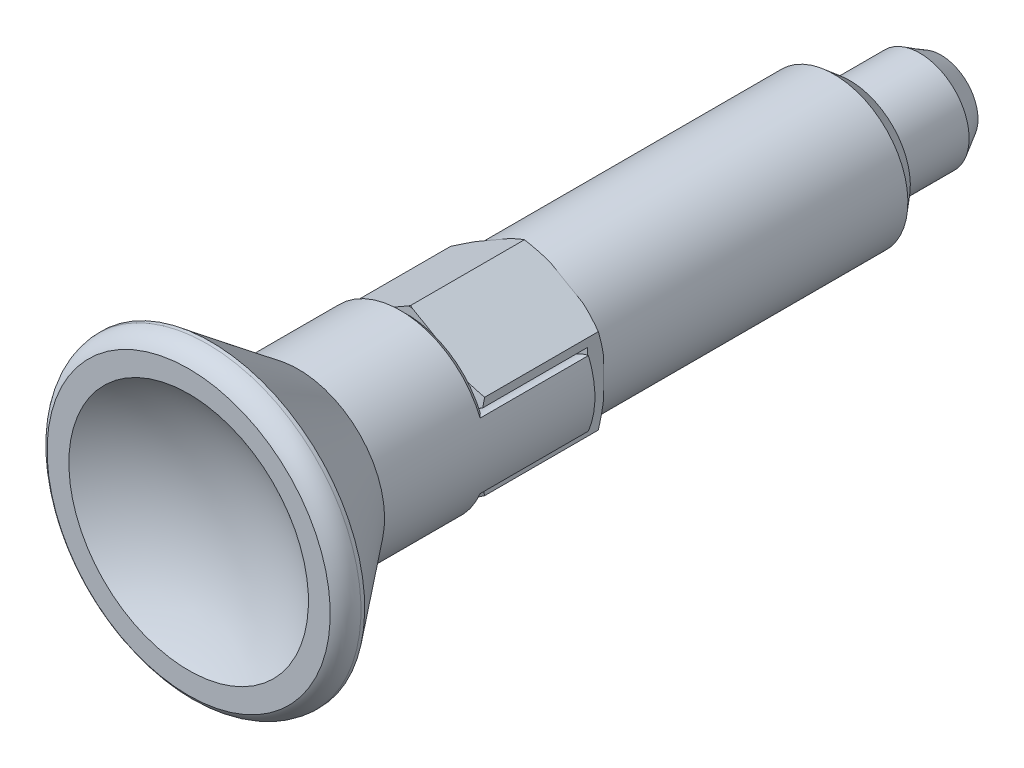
ISO-10303-21;
HEADER;
FILE_DESCRIPTION(('STEP AP214'),'2;1');
FILE_NAME('part.step','',(''),(''),'','','');
FILE_SCHEMA(('AUTOMOTIVE_DESIGN { 1 0 10303 214 1 1 1 1 }'));
ENDSEC;
DATA;
#1=APPLICATION_CONTEXT('core data for automotive mechanical design processes');
#2=APPLICATION_PROTOCOL_DEFINITION('international standard','automotive_design',2000,#1);
#3=PRODUCT_CONTEXT('',#1,'mechanical');
#4=PRODUCT('Part','Part','',(#3));
#5=PRODUCT_RELATED_PRODUCT_CATEGORY('part','',(#4));
#6=PRODUCT_DEFINITION_FORMATION('','',#4);
#7=PRODUCT_DEFINITION_CONTEXT('part definition',#1,'design');
#8=PRODUCT_DEFINITION('design','',#6,#7);
#9=PRODUCT_DEFINITION_SHAPE('','',#8);
#10=(LENGTH_UNIT() NAMED_UNIT(*) SI_UNIT(.MILLI.,.METRE.));
#11=(NAMED_UNIT(*) PLANE_ANGLE_UNIT() SI_UNIT($,.RADIAN.));
#12=(NAMED_UNIT(*) SI_UNIT($,.STERADIAN.) SOLID_ANGLE_UNIT());
#13=UNCERTAINTY_MEASURE_WITH_UNIT(LENGTH_MEASURE(1.E-05),#10,'distance_accuracy_value','');
#14=(GEOMETRIC_REPRESENTATION_CONTEXT(3) GLOBAL_UNCERTAINTY_ASSIGNED_CONTEXT((#13)) GLOBAL_UNIT_ASSIGNED_CONTEXT((#10,
#11,#12)) REPRESENTATION_CONTEXT('',''));
#15=CARTESIAN_POINT('',(0.,0.,0.));
#16=DIRECTION('',(0.,0.,1.));
#17=DIRECTION('',(1.,0.,0.));
#18=AXIS2_PLACEMENT_3D('',#15,#16,#17);
#19=CARTESIAN_POINT('',(0.,0.,-26.));
#20=DIRECTION('',(0.,0.,1.));
#21=DIRECTION('',(0.,-1.,0.));
#22=AXIS2_PLACEMENT_3D('',#19,#20,#21);
#23=CYLINDRICAL_SURFACE('',#22,6.);
#24=CARTESIAN_POINT('',(0.,0.,0.));
#25=DIRECTION('',(0.,0.,1.));
#26=DIRECTION('',(0.,-1.,0.));
#27=AXIS2_PLACEMENT_3D('',#24,#25,#26);
#28=CIRCLE('',#27,6.);
#29=CARTESIAN_POINT('',(-3.,5.19615242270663,0.));
#30=VERTEX_POINT('',#29);
#31=CARTESIAN_POINT('',(-6.,0.,0.));
#32=VERTEX_POINT('',#31);
#33=EDGE_CURVE('E241',#30,#32,#28,.T.);
#34=ORIENTED_EDGE('',*,*,#33,.F.);
#35=CARTESIAN_POINT('',(0.,0.,0.));
#36=DIRECTION('',(0.,0.,1.));
#37=DIRECTION('',(0.,-1.,0.));
#38=AXIS2_PLACEMENT_3D('',#35,#36,#37);
#39=CIRCLE('',#38,6.);
#40=CARTESIAN_POINT('',(3.,5.19615242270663,0.));
#41=VERTEX_POINT('',#40);
#42=EDGE_CURVE('E1097',#41,#30,#39,.T.);
#43=ORIENTED_EDGE('',*,*,#42,.F.);
#44=CARTESIAN_POINT('',(0.,0.,0.));
#45=DIRECTION('',(0.,0.,1.));
#46=DIRECTION('',(0.,-1.,0.));
#47=AXIS2_PLACEMENT_3D('',#44,#45,#46);
#48=CIRCLE('',#47,6.);
#49=CARTESIAN_POINT('',(6.,0.,0.));
#50=VERTEX_POINT('',#49);
#51=EDGE_CURVE('E282',#50,#41,#48,.T.);
#52=ORIENTED_EDGE('',*,*,#51,.F.);
#53=CARTESIAN_POINT('',(0.,0.,0.));
#54=DIRECTION('',(0.,0.,1.));
#55=DIRECTION('',(0.,-1.,0.));
#56=AXIS2_PLACEMENT_3D('',#53,#54,#55);
#57=CIRCLE('',#56,6.);
#58=CARTESIAN_POINT('',(3.,-5.19615242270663,0.));
#59=VERTEX_POINT('',#58);
#60=EDGE_CURVE('E1093',#59,#50,#57,.T.);
#61=ORIENTED_EDGE('',*,*,#60,.F.);
#62=CARTESIAN_POINT('',(0.,0.,0.));
#63=DIRECTION('',(0.,0.,1.));
#64=DIRECTION('',(0.,-1.,0.));
#65=AXIS2_PLACEMENT_3D('',#62,#63,#64);
#66=CIRCLE('',#65,6.);
#67=CARTESIAN_POINT('',(-3.,-5.19615242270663,0.));
#68=VERTEX_POINT('',#67);
#69=EDGE_CURVE('E270',#68,#59,#66,.T.);
#70=ORIENTED_EDGE('',*,*,#69,.F.);
#71=CARTESIAN_POINT('',(0.,0.,0.));
#72=DIRECTION('',(0.,0.,1.));
#73=DIRECTION('',(0.,-1.,0.));
#74=AXIS2_PLACEMENT_3D('',#71,#72,#73);
#75=CIRCLE('',#74,6.);
#76=EDGE_CURVE('E261',#32,#68,#75,.T.);
#77=ORIENTED_EDGE('',*,*,#76,.F.);
#78=EDGE_LOOP('',(#34,#43,#52,#61,#70,#77));
#79=FACE_BOUND('',#78,.T.);
#80=CARTESIAN_POINT('',(0.,0.,-24.7265));
#81=DIRECTION('',(0.,0.,1.));
#82=DIRECTION('',(0.,-1.,0.));
#83=AXIS2_PLACEMENT_3D('',#80,#81,#82);
#84=CIRCLE('',#83,6.);
#85=CARTESIAN_POINT('',(0.,-6.,-24.7265));
#86=VERTEX_POINT('',#85);
#87=EDGE_CURVE('E275',#86,#86,#84,.T.);
#88=ORIENTED_EDGE('',*,*,#87,.T.);
#89=EDGE_LOOP('',(#88));
#90=FACE_BOUND('',#89,.T.);
#91=ADVANCED_FACE('F14',(#79,#90),#23,.T.);
#92=CARTESIAN_POINT('',(6.,0.,0.));
#93=DIRECTION('',(0.,0.,-1.));
#94=DIRECTION('',(0.,1.,0.));
#95=AXIS2_PLACEMENT_3D('',#92,#93,#94);
#96=PLANE('',#95);
#97=CARTESIAN_POINT('',(0.,0.,2.66817817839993E-11));
#98=DIRECTION('',(0.,0.,1.));
#99=DIRECTION('',(0.,-1.,0.));
#100=AXIS2_PLACEMENT_3D('',#97,#98,#99);
#101=CIRCLE('',#100,6.1999999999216);
#102=CARTESIAN_POINT('',(-4.35277492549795,4.41512745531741,1.33417582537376E-11));
#103=VERTEX_POINT('',#102);
#104=CARTESIAN_POINT('',(-6.,1.56204993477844,1.33417582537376E-11));
#105=VERTEX_POINT('',#104);
#106=EDGE_CURVE('E1088',#103,#105,#101,.T.);
#107=ORIENTED_EDGE('',*,*,#106,.F.);
#108=DIRECTION('',(0.866025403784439,0.5,0.));
#109=VECTOR('',#108,1.);
#110=CARTESIAN_POINT('',(-4.35277492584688,4.41512745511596,0.));
#111=LINE('',#110,#109);
#112=EDGE_CURVE('E256',#103,#30,#111,.T.);
#113=ORIENTED_EDGE('',*,*,#112,.T.);
#114=ORIENTED_EDGE('',*,*,#33,.T.);
#115=DIRECTION('',(0.,1.,0.));
#116=VECTOR('',#115,1.);
#117=CARTESIAN_POINT('',(-6.,0.,0.));
#118=LINE('',#117,#116);
#119=EDGE_CURVE('E246',#32,#105,#118,.T.);
#120=ORIENTED_EDGE('',*,*,#119,.T.);
#121=EDGE_LOOP('',(#107,#113,#114,#120));
#122=FACE_BOUND('',#121,.T.);
#123=ADVANCED_FACE('F274',(#122),#96,.T.);
#124=CARTESIAN_POINT('',(6.,0.,0.));
#125=DIRECTION('',(0.,0.,-1.));
#126=DIRECTION('',(0.,1.,0.));
#127=AXIS2_PLACEMENT_3D('',#124,#125,#126);
#128=PLANE('',#127);
#129=CARTESIAN_POINT('',(0.,0.,2.66817817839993E-11));
#130=DIRECTION('',(0.,0.,1.));
#131=DIRECTION('',(0.,-1.,0.));
#132=AXIS2_PLACEMENT_3D('',#129,#130,#131);
#133=CIRCLE('',#132,6.1999999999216);
#134=CARTESIAN_POINT('',(6.,1.56204993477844,1.33417582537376E-11));
#135=VERTEX_POINT('',#134);
#136=CARTESIAN_POINT('',(4.35277492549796,4.41512745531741,1.33417582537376E-11));
#137=VERTEX_POINT('',#136);
#138=EDGE_CURVE('E1085',#135,#137,#133,.T.);
#139=ORIENTED_EDGE('',*,*,#138,.F.);
#140=DIRECTION('',(0.,1.,0.));
#141=VECTOR('',#140,1.);
#142=CARTESIAN_POINT('',(6.,0.,0.));
#143=LINE('',#142,#141);
#144=EDGE_CURVE('E1099',#135,#50,#143,.F.);
#145=ORIENTED_EDGE('',*,*,#144,.T.);
#146=ORIENTED_EDGE('',*,*,#51,.T.);
#147=DIRECTION('',(0.866025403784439,-0.5,0.));
#148=VECTOR('',#147,1.);
#149=CARTESIAN_POINT('',(3.,5.19615242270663,0.));
#150=LINE('',#149,#148);
#151=EDGE_CURVE('E1104',#41,#137,#150,.T.);
#152=ORIENTED_EDGE('',*,*,#151,.T.);
#153=EDGE_LOOP('',(#139,#145,#146,#152));
#154=FACE_BOUND('',#153,.T.);
#155=ADVANCED_FACE('F861',(#154),#128,.T.);
#156=CARTESIAN_POINT('',(6.,0.,0.));
#157=DIRECTION('',(0.,0.,-1.));
#158=DIRECTION('',(0.,1.,0.));
#159=AXIS2_PLACEMENT_3D('',#156,#157,#158);
#160=PLANE('',#159);
#161=CARTESIAN_POINT('',(0.,0.,2.66835165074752E-11));
#162=DIRECTION('',(0.,0.,1.));
#163=DIRECTION('',(0.,-1.,0.));
#164=AXIS2_PLACEMENT_3D('',#161,#162,#163);
#165=CIRCLE('',#164,6.1999999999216);
#166=CARTESIAN_POINT('',(1.64722507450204,5.97717739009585,1.33417582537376E-11));
#167=VERTEX_POINT('',#166);
#168=CARTESIAN_POINT('',(-1.64722507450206,5.97717739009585,1.33417582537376E-11));
#169=VERTEX_POINT('',#168);
#170=EDGE_CURVE('E1082',#167,#169,#165,.T.);
#171=ORIENTED_EDGE('',*,*,#170,.F.);
#172=DIRECTION('',(0.866025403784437,-0.5,0.));
#173=VECTOR('',#172,1.);
#174=CARTESIAN_POINT('',(1.64722507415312,5.97717739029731,0.));
#175=LINE('',#174,#173);
#176=EDGE_CURVE('E1096',#167,#41,#175,.T.);
#177=ORIENTED_EDGE('',*,*,#176,.T.);
#178=ORIENTED_EDGE('',*,*,#42,.T.);
#179=DIRECTION('',(0.866025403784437,0.5,0.));
#180=VECTOR('',#179,1.);
#181=CARTESIAN_POINT('',(-3.,5.19615242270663,0.));
#182=LINE('',#181,#180);
#183=EDGE_CURVE('E1098',#30,#169,#182,.T.);
#184=ORIENTED_EDGE('',*,*,#183,.T.);
#185=EDGE_LOOP('',(#171,#177,#178,#184));
#186=FACE_BOUND('',#185,.T.);
#187=ADVANCED_FACE('F851',(#186),#160,.T.);
#188=CARTESIAN_POINT('',(6.,0.,0.));
#189=DIRECTION('',(0.,0.,-1.));
#190=DIRECTION('',(0.,1.,0.));
#191=AXIS2_PLACEMENT_3D('',#188,#189,#190);
#192=PLANE('',#191);
#193=CARTESIAN_POINT('',(0.,0.,2.66817817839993E-11));
#194=DIRECTION('',(0.,0.,1.));
#195=DIRECTION('',(0.,-1.,0.));
#196=AXIS2_PLACEMENT_3D('',#193,#194,#195);
#197=CIRCLE('',#196,6.1999999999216);
#198=CARTESIAN_POINT('',(4.35277492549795,-4.41512745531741,1.33417582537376E-11));
#199=VERTEX_POINT('',#198);
#200=CARTESIAN_POINT('',(6.,-1.56204993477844,1.33417582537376E-11));
#201=VERTEX_POINT('',#200);
#202=EDGE_CURVE('E1077',#199,#201,#197,.T.);
#203=ORIENTED_EDGE('',*,*,#202,.F.);
#204=DIRECTION('',(-0.866025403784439,-0.5,0.));
#205=VECTOR('',#204,1.);
#206=CARTESIAN_POINT('',(4.35277492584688,-4.41512745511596,0.));
#207=LINE('',#206,#205);
#208=EDGE_CURVE('E265',#199,#59,#207,.T.);
#209=ORIENTED_EDGE('',*,*,#208,.T.);
#210=ORIENTED_EDGE('',*,*,#60,.T.);
#211=DIRECTION('',(0.,1.,0.));
#212=VECTOR('',#211,1.);
#213=CARTESIAN_POINT('',(6.,0.,0.));
#214=LINE('',#213,#212);
#215=EDGE_CURVE('E1095',#50,#201,#214,.F.);
#216=ORIENTED_EDGE('',*,*,#215,.T.);
#217=EDGE_LOOP('',(#203,#209,#210,#216));
#218=FACE_BOUND('',#217,.T.);
#219=ADVANCED_FACE('F842',(#218),#192,.T.);
#220=CARTESIAN_POINT('',(6.,0.,0.));
#221=DIRECTION('',(0.,0.,-1.));
#222=DIRECTION('',(0.,1.,0.));
#223=AXIS2_PLACEMENT_3D('',#220,#221,#222);
#224=PLANE('',#223);
#225=ORIENTED_EDGE('',*,*,#76,.T.);
#226=DIRECTION('',(-0.866025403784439,0.5,0.));
#227=VECTOR('',#226,1.);
#228=CARTESIAN_POINT('',(-3.,-5.19615242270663,0.));
#229=LINE('',#228,#227);
#230=CARTESIAN_POINT('',(-4.35277492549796,-4.41512745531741,1.33417582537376E-11));
#231=VERTEX_POINT('',#230);
#232=EDGE_CURVE('E271',#68,#231,#229,.T.);
#233=ORIENTED_EDGE('',*,*,#232,.T.);
#234=CARTESIAN_POINT('',(0.,0.,2.66817817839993E-11));
#235=DIRECTION('',(0.,0.,1.));
#236=DIRECTION('',(0.,-1.,0.));
#237=AXIS2_PLACEMENT_3D('',#234,#235,#236);
#238=CIRCLE('',#237,6.1999999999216);
#239=CARTESIAN_POINT('',(-6.,-1.56204993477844,1.33417582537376E-11));
#240=VERTEX_POINT('',#239);
#241=EDGE_CURVE('E263',#240,#231,#238,.T.);
#242=ORIENTED_EDGE('',*,*,#241,.F.);
#243=DIRECTION('',(0.,1.,0.));
#244=VECTOR('',#243,1.);
#245=CARTESIAN_POINT('',(-6.,0.,0.));
#246=LINE('',#245,#244);
#247=EDGE_CURVE('E249',#240,#32,#246,.T.);
#248=ORIENTED_EDGE('',*,*,#247,.T.);
#249=EDGE_LOOP('',(#225,#233,#242,#248));
#250=FACE_BOUND('',#249,.T.);
#251=ADVANCED_FACE('F260',(#250),#224,.T.);
#252=CARTESIAN_POINT('',(6.,0.,0.));
#253=DIRECTION('',(0.,0.,-1.));
#254=DIRECTION('',(0.,1.,0.));
#255=AXIS2_PLACEMENT_3D('',#252,#253,#254);
#256=PLANE('',#255);
#257=CARTESIAN_POINT('',(0.,0.,2.66817817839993E-11));
#258=DIRECTION('',(0.,0.,1.));
#259=DIRECTION('',(0.,-1.,0.));
#260=AXIS2_PLACEMENT_3D('',#257,#258,#259);
#261=CIRCLE('',#260,6.1999999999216);
#262=CARTESIAN_POINT('',(-1.64722507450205,-5.97717739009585,1.33417582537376E-11));
#263=VERTEX_POINT('',#262);
#264=CARTESIAN_POINT('',(1.64722507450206,-5.97717739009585,1.33417582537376E-11));
#265=VERTEX_POINT('',#264);
#266=EDGE_CURVE('E1192',#263,#265,#261,.T.);
#267=ORIENTED_EDGE('',*,*,#266,.F.);
#268=DIRECTION('',(-0.866025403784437,0.5,0.));
#269=VECTOR('',#268,1.);
#270=CARTESIAN_POINT('',(-1.64722507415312,-5.97717739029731,0.));
#271=LINE('',#270,#269);
#272=EDGE_CURVE('E1090',#263,#68,#271,.T.);
#273=ORIENTED_EDGE('',*,*,#272,.T.);
#274=ORIENTED_EDGE('',*,*,#69,.T.);
#275=DIRECTION('',(-0.866025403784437,-0.5,0.));
#276=VECTOR('',#275,1.);
#277=CARTESIAN_POINT('',(3.,-5.19615242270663,0.));
#278=LINE('',#277,#276);
#279=EDGE_CURVE('E1091',#59,#265,#278,.T.);
#280=ORIENTED_EDGE('',*,*,#279,.T.);
#281=EDGE_LOOP('',(#267,#273,#274,#280));
#282=FACE_BOUND('',#281,.T.);
#283=ADVANCED_FACE('F823',(#282),#256,.T.);
#284=CARTESIAN_POINT('',(0.,0.,0.422950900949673));
#285=DIRECTION('',(0.,0.,1.));
#286=DIRECTION('',(0.,-1.,0.));
#287=AXIS2_PLACEMENT_3D('',#284,#285,#286);
#288=CONICAL_SURFACE('',#287,6.93257244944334,1.04719755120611);
#289=CARTESIAN_POINT('',(-6.00000000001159,3.46410161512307,0.420428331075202));
#290=CARTESIAN_POINT('',(-6.00000000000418,3.30795208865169,0.375356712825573));
#291=CARTESIAN_POINT('',(-6.00000000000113,3.15117861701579,0.332381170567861));
#292=CARTESIAN_POINT('',(-5.99999999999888,2.83657949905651,0.251283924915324));
#293=CARTESIAN_POINT('',(-5.99999999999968,2.67875529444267,0.213156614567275));
#294=CARTESIAN_POINT('',(-6.00000000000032,2.36185533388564,0.142302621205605));
#295=CARTESIAN_POINT('',(-6.00000000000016,2.20277934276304,0.109576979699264));
#296=CARTESIAN_POINT('',(-5.99999999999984,1.88332260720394,0.0501190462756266));
#297=CARTESIAN_POINT('',(-5.99999999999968,1.72294055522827,0.0233938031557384));
#298=CARTESIAN_POINT('',(-6.,1.56204993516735,6.99110908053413E-11));
#299=B_SPLINE_CURVE_WITH_KNOTS('',3,(#289,#290,#291,#292,#293,#294,#295,#296,#297,#298),
.UNSPECIFIED.,.F.,.F.,(4,2,2,2,4),(0.,0.487584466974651,0.974599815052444,1.46170895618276,
1.9493873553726),.UNSPECIFIED.);
#300=CARTESIAN_POINT('',(-6.,3.4641016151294,0.420428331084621));
#301=VERTEX_POINT('',#300);
#302=EDGE_CURVE('E252',#301,#105,#299,.T.);
#303=ORIENTED_EDGE('',*,*,#302,.F.);
#304=CARTESIAN_POINT('',(-4.35277492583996,4.4151274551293,6.52828485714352E-11));
#305=CARTESIAN_POINT('',(-4.49211029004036,4.3346821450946,0.0233938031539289));
#306=CARTESIAN_POINT('',(-4.63100522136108,4.25449111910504,0.0501190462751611));
#307=CARTESIAN_POINT('',(-4.90766286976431,4.09476275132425,0.109576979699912));
#308=CARTESIAN_POINT('',(-5.04542671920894,4.01522475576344,0.142302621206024));
#309=CARTESIAN_POINT('',(-5.31987013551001,3.85677477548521,0.213156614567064));
#310=CARTESIAN_POINT('',(-5.45654990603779,3.7778626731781,0.251283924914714));
#311=CARTESIAN_POINT('',(-5.72900073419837,3.62056311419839,0.332381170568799));
#312=CARTESIAN_POINT('',(-5.86477054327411,3.54217637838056,0.375356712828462));
#313=CARTESIAN_POINT('',(-5.99999999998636,3.46410161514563,0.420428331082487));
#314=B_SPLINE_CURVE_WITH_KNOTS('',3,(#304,#305,#306,#307,#308,#309,#310,#311,#312,#313),
.UNSPECIFIED.,.F.,.F.,(4,2,2,2,4),(0.,0.487678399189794,0.974787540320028,1.46180288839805,
1.94938735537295),.UNSPECIFIED.);
#315=EDGE_CURVE('E937',#103,#301,#314,.T.);
#316=ORIENTED_EDGE('',*,*,#315,.F.);
#317=ORIENTED_EDGE('',*,*,#106,.T.);
#318=EDGE_LOOP('',(#303,#316,#317));
#319=FACE_BOUND('',#318,.T.);
#320=ADVANCED_FACE('F742',(#319),#288,.T.);
#321=CARTESIAN_POINT('',(0.,0.,0.422950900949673));
#322=DIRECTION('',(0.,0.,1.));
#323=DIRECTION('',(0.,-1.,0.));
#324=AXIS2_PLACEMENT_3D('',#321,#322,#323);
#325=CONICAL_SURFACE('',#324,6.93257244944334,1.04719755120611);
#326=CARTESIAN_POINT('',(5.99999999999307,3.46410161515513,0.420428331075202));
#327=CARTESIAN_POINT('',(5.86477054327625,3.5421763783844,0.375356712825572));
#328=CARTESIAN_POINT('',(5.72900073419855,3.62056311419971,0.332381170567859));
#329=CARTESIAN_POINT('',(5.45654990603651,3.7778626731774,0.251283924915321));
#330=CARTESIAN_POINT('',(5.31987013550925,3.85677477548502,0.213156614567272));
#331=CARTESIAN_POINT('',(5.04542671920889,4.01522475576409,0.142302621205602));
#332=CARTESIAN_POINT('',(4.90766286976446,4.09476275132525,0.109576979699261));
#333=CARTESIAN_POINT('',(4.63100522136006,4.25449111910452,0.0501190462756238));
#334=CARTESIAN_POINT('',(4.49211029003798,4.33468214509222,0.0233938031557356));
#335=CARTESIAN_POINT('',(4.35277492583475,4.41512745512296,6.99076213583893E-11));
#336=B_SPLINE_CURVE_WITH_KNOTS('',3,(#326,#327,#328,#329,#330,#331,#332,#333,#334,#335),
.UNSPECIFIED.,.F.,.F.,(4,2,2,2,4),(0.,0.487584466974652,0.974599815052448,1.46170895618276,
1.94938735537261),.UNSPECIFIED.);
#337=CARTESIAN_POINT('',(5.99999999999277,3.46410161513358,0.420428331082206));
#338=VERTEX_POINT('',#337);
#339=EDGE_CURVE('E1126',#338,#137,#336,.T.);
#340=ORIENTED_EDGE('',*,*,#339,.F.);
#341=CARTESIAN_POINT('',(6.00000000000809,1.56204993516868,6.52845832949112E-11));
#342=CARTESIAN_POINT('',(6.00000000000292,1.72294055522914,0.0233938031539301));
#343=CARTESIAN_POINT('',(6.00000000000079,1.88332260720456,0.0501190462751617));
#344=CARTESIAN_POINT('',(5.99999999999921,2.20277934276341,0.109576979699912));
#345=CARTESIAN_POINT('',(5.99999999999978,2.361855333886,0.142302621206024));
#346=CARTESIAN_POINT('',(6.00000000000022,2.67875529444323,0.213156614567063));
#347=CARTESIAN_POINT('',(6.00000000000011,2.83657949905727,0.251283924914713));
#348=CARTESIAN_POINT('',(5.99999999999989,3.1511786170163,0.332381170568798));
#349=CARTESIAN_POINT('',(5.99999999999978,3.30795208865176,0.375356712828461));
#350=CARTESIAN_POINT('',(6.,3.464101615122,0.420428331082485));
#351=B_SPLINE_CURVE_WITH_KNOTS('',3,(#341,#342,#343,#344,#345,#346,#347,#348,#349,#350),
.UNSPECIFIED.,.F.,.F.,(4,2,2,2,4),(0.,0.487678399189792,0.974787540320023,1.46180288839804,
1.94938735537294),.UNSPECIFIED.);
#352=EDGE_CURVE('E1070',#135,#338,#351,.T.);
#353=ORIENTED_EDGE('',*,*,#352,.F.);
#354=ORIENTED_EDGE('',*,*,#138,.T.);
#355=EDGE_LOOP('',(#340,#353,#354));
#356=FACE_BOUND('',#355,.T.);
#357=ADVANCED_FACE('F736',(#356),#325,.T.);
#358=CARTESIAN_POINT('',(0.,0.,0.422950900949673));
#359=DIRECTION('',(0.,0.,1.));
#360=DIRECTION('',(0.,-1.,0.));
#361=AXIS2_PLACEMENT_3D('',#358,#359,#360);
#362=CONICAL_SURFACE('',#361,6.93257244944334,1.04719755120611);
#363=CARTESIAN_POINT('',(-1.8517625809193E-11,6.9282032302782,0.420428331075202));
#364=CARTESIAN_POINT('',(-0.135229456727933,6.8501284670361,0.375356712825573));
#365=CARTESIAN_POINT('',(-0.270999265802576,6.7717417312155,0.332381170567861));
#366=CARTESIAN_POINT('',(-0.543450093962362,6.61444217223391,0.251283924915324));
#367=CARTESIAN_POINT('',(-0.680129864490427,6.53553006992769,0.213156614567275));
#368=CARTESIAN_POINT('',(-0.954573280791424,6.37708008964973,0.142302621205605));
#369=CARTESIAN_POINT('',(-1.0923371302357,6.29754209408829,0.109576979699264));
#370=CARTESIAN_POINT('',(-1.36899477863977,6.13781372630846,0.0501190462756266));
#371=CARTESIAN_POINT('',(-1.5078897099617,6.05762270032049,0.0233938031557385));
#372=CARTESIAN_POINT('',(-1.64722507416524,5.9771773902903,6.99110908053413E-11));
#373=B_SPLINE_CURVE_WITH_KNOTS('',3,(#363,#364,#365,#366,#367,#368,#369,#370,#371,#372),
.UNSPECIFIED.,.F.,.F.,(4,2,2,2,4),(0.,0.487584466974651,0.974599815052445,1.46170895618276,
1.9493873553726),.UNSPECIFIED.);
#374=CARTESIAN_POINT('',(-7.23872023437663E-12,6.92820323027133,0.420428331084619));
#375=VERTEX_POINT('',#374);
#376=EDGE_CURVE('E946',#375,#169,#373,.T.);
#377=ORIENTED_EDGE('',*,*,#376,.F.);
#378=CARTESIAN_POINT('',(1.64722507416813,5.97717739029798,6.52793791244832E-11));
#379=CARTESIAN_POINT('',(1.50788970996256,6.05762270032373,0.0233938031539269));
#380=CARTESIAN_POINT('',(1.3689947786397,6.13781372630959,0.0501190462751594));
#381=CARTESIAN_POINT('',(1.0923371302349,6.29754209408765,0.109576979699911));
#382=CARTESIAN_POINT('',(0.954573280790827,6.37708008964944,0.142302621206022));
#383=CARTESIAN_POINT('',(0.680129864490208,6.53553006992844,0.213156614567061));
#384=CARTESIAN_POINT('',(0.543450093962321,6.61444217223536,0.251283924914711));
#385=CARTESIAN_POINT('',(0.27099926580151,6.77174173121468,0.332381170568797));
#386=CARTESIAN_POINT('',(0.135229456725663,6.85012846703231,0.375356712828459));
#387=CARTESIAN_POINT('',(1.36340649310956E-11,6.92820323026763,0.420428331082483));
#388=B_SPLINE_CURVE_WITH_KNOTS('',3,(#378,#379,#380,#381,#382,#383,#384,#385,#386,#387),
.UNSPECIFIED.,.F.,.F.,(4,2,2,2,4),(0.,0.487678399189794,0.974787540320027,1.46180288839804,
1.94938735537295),.UNSPECIFIED.);
#389=EDGE_CURVE('E1122',#167,#375,#388,.T.);
#390=ORIENTED_EDGE('',*,*,#389,.F.);
#391=ORIENTED_EDGE('',*,*,#170,.T.);
#392=EDGE_LOOP('',(#377,#390,#391));
#393=FACE_BOUND('',#392,.T.);
#394=ADVANCED_FACE('F741',(#393),#362,.T.);
#395=CARTESIAN_POINT('',(0.,0.,9.66019585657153));
#396=DIRECTION('',(0.,0.,-1.));
#397=DIRECTION('',(0.,1.,0.));
#398=AXIS2_PLACEMENT_3D('',#395,#396,#397);
#399=CONICAL_SURFACE('',#398,6.92871233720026,1.13446401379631);
#400=CARTESIAN_POINT('',(0.,0.,9.7));
#401=DIRECTION('',(0.,0.,-1.));
#402=DIRECTION('',(0.,1.,0.));
#403=AXIS2_PLACEMENT_3D('',#400,#401,#402);
#404=CIRCLE('',#403,6.84335207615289);
#405=CARTESIAN_POINT('',(0.149806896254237,6.84171217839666,9.7));
#406=VERTEX_POINT('',#405);
#407=CARTESIAN_POINT('',(-0.149806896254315,6.84171217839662,9.7));
#408=VERTEX_POINT('',#407);
#409=EDGE_CURVE('E1080',#406,#408,#404,.F.);
#410=ORIENTED_EDGE('',*,*,#409,.F.);
#411=CARTESIAN_POINT('',(0.,6.92820323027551,9.66043325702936));
#412=CARTESIAN_POINT('',(0.024943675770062,6.91380199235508,9.66714957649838));
#413=CARTESIAN_POINT('',(0.049899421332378,6.89939378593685,9.67380496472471));
#414=CARTESIAN_POINT('',(0.0998350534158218,6.87056343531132,9.68699387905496));
#415=CARTESIAN_POINT('',(0.124814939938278,6.85614129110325,9.69352740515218));
#416=CARTESIAN_POINT('',(0.149806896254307,6.84171217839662,9.7));
#417=B_SPLINE_CURVE_WITH_KNOTS('',3,(#411,#412,#413,#414,#415,#416),.UNSPECIFIED.,.F.,.F.,(4,2,
4),(0.,0.0887249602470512,0.17744992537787),.UNSPECIFIED.);
#418=CARTESIAN_POINT('',(0.,6.92820323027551,9.66043325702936));
#419=VERTEX_POINT('',#418);
#420=EDGE_CURVE('E1147',#419,#406,#417,.T.);
#421=ORIENTED_EDGE('',*,*,#420,.F.);
#422=CARTESIAN_POINT('',(-0.149806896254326,6.84171217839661,9.7));
#423=CARTESIAN_POINT('',(-0.124814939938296,6.85614129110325,9.69352740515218));
#424=CARTESIAN_POINT('',(-0.0998350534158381,6.87056343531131,9.68699387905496));
#425=CARTESIAN_POINT('',(-0.0498994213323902,6.89939378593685,9.67380496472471));
#426=CARTESIAN_POINT('',(-0.0249436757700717,6.91380199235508,9.66714957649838));
#427=CARTESIAN_POINT('',(0.,6.92820323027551,9.66043325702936));
#428=B_SPLINE_CURVE_WITH_KNOTS('',3,(#422,#423,#424,#425,#426,#427),.UNSPECIFIED.,.F.,.F.,(4,2,
4),(0.,0.0887249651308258,0.177449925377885),.UNSPECIFIED.);
#429=EDGE_CURVE('E1183',#408,#419,#428,.T.);
#430=ORIENTED_EDGE('',*,*,#429,.F.);
#431=EDGE_LOOP('',(#410,#421,#430));
#432=FACE_BOUND('',#431,.T.);
#433=ADVANCED_FACE('F728',(#432),#399,.T.);
#434=CARTESIAN_POINT('',(0.,0.,9.7));
#435=DIRECTION('',(0.,0.,1.));
#436=DIRECTION('',(0.,-1.,0.));
#437=AXIS2_PLACEMENT_3D('',#434,#435,#436);
#438=PLANE('',#437);
#439=ORIENTED_EDGE('',*,*,#409,.T.);
#440=DIRECTION('',(-0.866025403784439,-0.5,0.));
#441=VECTOR('',#440,1.);
#442=CARTESIAN_POINT('',(0.,6.92820323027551,9.7));
#443=LINE('',#442,#441);
#444=CARTESIAN_POINT('',(-2.52048906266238,5.47299819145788,9.7));
#445=VERTEX_POINT('',#444);
#446=EDGE_CURVE('E1180',#445,#408,#443,.F.);
#447=ORIENTED_EDGE('',*,*,#446,.F.);
#448=CARTESIAN_POINT('',(0.,7.1,9.7));
#449=DIRECTION('',(0.,0.,-1.));
#450=DIRECTION('',(0.,1.,0.));
#451=AXIS2_PLACEMENT_3D('',#448,#449,#450);
#452=CIRCLE('',#451,3.);
#453=CARTESIAN_POINT('',(2.52048906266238,5.47299819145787,9.7));
#454=VERTEX_POINT('',#453);
#455=EDGE_CURVE('E947',#445,#454,#452,.F.);
#456=ORIENTED_EDGE('',*,*,#455,.T.);
#457=DIRECTION('',(-0.866025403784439,0.5,0.));
#458=VECTOR('',#457,1.);
#459=CARTESIAN_POINT('',(6.,3.46410161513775,9.7));
#460=LINE('',#459,#458);
#461=EDGE_CURVE('E1171',#406,#454,#460,.F.);
#462=ORIENTED_EDGE('',*,*,#461,.F.);
#463=EDGE_LOOP('',(#439,#447,#456,#462));
#464=FACE_BOUND('',#463,.T.);
#465=ADVANCED_FACE('F718',(#464),#438,.T.);
#466=CARTESIAN_POINT('',(0.,0.,1.3));
#467=DIRECTION('',(0.,0.,1.));
#468=DIRECTION('',(0.,-1.,0.));
#469=AXIS2_PLACEMENT_3D('',#466,#467,#468);
#470=PLANE('',#469);
#471=CARTESIAN_POINT('',(7.1,0.,1.3));
#472=DIRECTION('',(0.,0.,-1.));
#473=DIRECTION('',(0.,1.,0.));
#474=AXIS2_PLACEMENT_3D('',#471,#472,#473);
#475=CIRCLE('',#474,3.);
#476=CARTESIAN_POINT('',(6.,2.79105714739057,1.3));
#477=VERTEX_POINT('',#476);
#478=CARTESIAN_POINT('',(6.,-2.79105714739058,1.3));
#479=VERTEX_POINT('',#478);
#480=EDGE_CURVE('E1164',#477,#479,#475,.F.);
#481=ORIENTED_EDGE('',*,*,#480,.T.);
#482=DIRECTION('',(0.,1.,0.));
#483=VECTOR('',#482,1.);
#484=CARTESIAN_POINT('',(6.,-3.46410161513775,1.3));
#485=LINE('',#484,#483);
#486=EDGE_CURVE('E1071',#477,#479,#485,.F.);
#487=ORIENTED_EDGE('',*,*,#486,.F.);
#488=EDGE_LOOP('',(#481,#487));
#489=FACE_BOUND('',#488,.T.);
#490=ADVANCED_FACE('F713',(#489),#470,.T.);
#491=CARTESIAN_POINT('',(0.,0.,0.422950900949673));
#492=DIRECTION('',(0.,0.,1.));
#493=DIRECTION('',(0.,-1.,0.));
#494=AXIS2_PLACEMENT_3D('',#491,#492,#493);
#495=CONICAL_SURFACE('',#494,6.93257244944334,1.04719755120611);
#496=CARTESIAN_POINT('',(6.00000000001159,-3.46410161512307,0.420428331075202));
#497=CARTESIAN_POINT('',(6.00000000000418,-3.30795208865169,0.375356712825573));
#498=CARTESIAN_POINT('',(6.00000000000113,-3.15117861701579,0.332381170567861));
#499=CARTESIAN_POINT('',(5.99999999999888,-2.83657949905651,0.251283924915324));
#500=CARTESIAN_POINT('',(5.99999999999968,-2.67875529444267,0.213156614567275));
#501=CARTESIAN_POINT('',(6.00000000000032,-2.36185533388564,0.142302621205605));
#502=CARTESIAN_POINT('',(6.00000000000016,-2.20277934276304,0.109576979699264));
#503=CARTESIAN_POINT('',(5.99999999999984,-1.88332260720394,0.0501190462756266));
#504=CARTESIAN_POINT('',(5.99999999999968,-1.72294055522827,0.0233938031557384));
#505=CARTESIAN_POINT('',(6.,-1.56204993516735,6.99110908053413E-11));
#506=B_SPLINE_CURVE_WITH_KNOTS('',3,(#496,#497,#498,#499,#500,#501,#502,#503,#504,#505),
.UNSPECIFIED.,.F.,.F.,(4,2,2,2,4),(0.,0.487584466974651,0.974599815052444,1.46170895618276,
1.9493873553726),.UNSPECIFIED.);
#507=CARTESIAN_POINT('',(6.,-3.4641016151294,0.420428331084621));
#508=VERTEX_POINT('',#507);
#509=EDGE_CURVE('E1062',#508,#201,#506,.T.);
#510=ORIENTED_EDGE('',*,*,#509,.F.);
#511=CARTESIAN_POINT('',(4.35277492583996,-4.4151274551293,6.52845832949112E-11));
#512=CARTESIAN_POINT('',(4.49211029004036,-4.3346821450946,0.0233938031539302));
#513=CARTESIAN_POINT('',(4.63100522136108,-4.25449111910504,0.0501190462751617));
#514=CARTESIAN_POINT('',(4.90766286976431,-4.09476275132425,0.109576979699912));
#515=CARTESIAN_POINT('',(5.04542671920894,-4.01522475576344,0.142302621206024));
#516=CARTESIAN_POINT('',(5.31987013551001,-3.85677477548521,0.213156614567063));
#517=CARTESIAN_POINT('',(5.45654990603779,-3.7778626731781,0.251283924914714));
#518=CARTESIAN_POINT('',(5.72900073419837,-3.62056311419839,0.3323811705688));
#519=CARTESIAN_POINT('',(5.86477054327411,-3.54217637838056,0.375356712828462));
#520=CARTESIAN_POINT('',(5.99999999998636,-3.46410161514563,0.420428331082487));
#521=B_SPLINE_CURVE_WITH_KNOTS('',3,(#511,#512,#513,#514,#515,#516,#517,#518,#519,#520),
.UNSPECIFIED.,.F.,.F.,(4,2,2,2,4),(0.,0.487678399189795,0.974787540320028,1.46180288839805,
1.94938735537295),.UNSPECIFIED.);
#522=EDGE_CURVE('E1051',#199,#508,#521,.T.);
#523=ORIENTED_EDGE('',*,*,#522,.F.);
#524=ORIENTED_EDGE('',*,*,#202,.T.);
#525=EDGE_LOOP('',(#510,#523,#524));
#526=FACE_BOUND('',#525,.T.);
#527=ADVANCED_FACE('F705',(#526),#495,.T.);
#528=CARTESIAN_POINT('',(6.,-3.46410161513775,0.));
#529=DIRECTION('',(1.,0.,0.));
#530=DIRECTION('',(0.,1.,0.));
#531=AXIS2_PLACEMENT_3D('',#528,#529,#530);
#532=PLANE('',#531);
#533=DIRECTION('',(0.,0.,1.));
#534=VECTOR('',#533,1.);
#535=CARTESIAN_POINT('',(6.,3.46410161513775,0.));
#536=LINE('',#535,#534);
#537=CARTESIAN_POINT('',(6.00000001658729,3.46410160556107,9.66043325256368));
#538=VERTEX_POINT('',#537);
#539=EDGE_CURVE('E1128',#538,#338,#536,.F.);
#540=ORIENTED_EDGE('',*,*,#539,.F.);
#541=CARTESIAN_POINT('',(6.,2.79105714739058,9.80536257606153));
#542=CARTESIAN_POINT('',(6.,2.8473565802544,9.79428974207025));
#543=CARTESIAN_POINT('',(6.,2.90360367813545,9.78295181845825));
#544=CARTESIAN_POINT('',(6.,3.01598855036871,9.75976744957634));
#545=CARTESIAN_POINT('',(6.,3.07212633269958,9.74792104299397));
#546=CARTESIAN_POINT('',(6.,3.18429619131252,9.72373973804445));
#547=CARTESIAN_POINT('',(6.,3.2403282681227,9.71140484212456));
#548=CARTESIAN_POINT('',(6.,3.35229154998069,9.68626577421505));
#549=CARTESIAN_POINT('',(6.,3.40822274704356,9.67346156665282));
#550=CARTESIAN_POINT('',(6.,3.46410152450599,9.6604332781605));
#551=B_SPLINE_CURVE_WITH_KNOTS('',3,(#541,#542,#543,#544,#545,#546,#547,#548,#549,#550),
.UNSPECIFIED.,.F.,.F.,(4,2,2,2,4),(0.,0.172133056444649,0.344253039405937,0.516372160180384,
0.688504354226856),.UNSPECIFIED.);
#552=CARTESIAN_POINT('',(6.,2.79105714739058,9.80536257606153));
#553=VERTEX_POINT('',#552);
#554=EDGE_CURVE('E1163',#553,#538,#551,.T.);
#555=ORIENTED_EDGE('',*,*,#554,.F.);
#556=DIRECTION('',(0.,0.,-1.));
#557=VECTOR('',#556,1.);
#558=CARTESIAN_POINT('',(6.,2.79105714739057,1.3));
#559=LINE('',#558,#557);
#560=EDGE_CURVE('E1162',#553,#477,#559,.T.);
#561=ORIENTED_EDGE('',*,*,#560,.T.);
#562=ORIENTED_EDGE('',*,*,#486,.T.);
#563=DIRECTION('',(0.,0.,-1.));
#564=VECTOR('',#563,1.);
#565=CARTESIAN_POINT('',(6.,-2.79105714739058,1.3));
#566=LINE('',#565,#564);
#567=CARTESIAN_POINT('',(5.9999999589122,-2.79105713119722,9.80536259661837));
#568=VERTEX_POINT('',#567);
#569=EDGE_CURVE('E1246',#479,#568,#566,.F.);
#570=ORIENTED_EDGE('',*,*,#569,.T.);
#571=CARTESIAN_POINT('',(6.,-3.46410161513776,9.66043325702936));
#572=CARTESIAN_POINT('',(6.,-3.40822282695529,9.67346154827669));
#573=CARTESIAN_POINT('',(6.,-3.35229161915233,9.68626575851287));
#574=CARTESIAN_POINT('',(6.,-3.24032831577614,9.71140483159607));
#575=CARTESIAN_POINT('',(6.,-3.18429622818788,9.72373973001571));
#576=CARTESIAN_POINT('',(6.,-3.07212634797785,9.74792103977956));
#577=CARTESIAN_POINT('',(6.,-3.01598855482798,9.75976744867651));
#578=CARTESIAN_POINT('',(6.,-2.90360366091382,9.78295182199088));
#579=CARTESIAN_POINT('',(6.,-2.84735655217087,9.79428974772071));
#580=CARTESIAN_POINT('',(6.,-2.791057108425,9.80536258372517));
#581=B_SPLINE_CURVE_WITH_KNOTS('',3,(#571,#572,#573,#574,#575,#576,#577,#578,#579,#580),
.UNSPECIFIED.,.F.,.F.,(4,2,2,2,4),(0.,0.172132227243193,0.344251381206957,0.516371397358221,
0.688504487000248),.UNSPECIFIED.);
#582=CARTESIAN_POINT('',(6.,-3.46410161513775,9.66043325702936));
#583=VERTEX_POINT('',#582);
#584=EDGE_CURVE('E1033',#583,#568,#581,.T.);
#585=ORIENTED_EDGE('',*,*,#584,.F.);
#586=DIRECTION('',(0.,0.,1.));
#587=VECTOR('',#586,1.);
#588=CARTESIAN_POINT('',(6.,-3.46410161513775,0.));
#589=LINE('',#588,#587);
#590=EDGE_CURVE('E1057',#508,#583,#589,.T.);
#591=ORIENTED_EDGE('',*,*,#590,.F.);
#592=ORIENTED_EDGE('',*,*,#509,.T.);
#593=ORIENTED_EDGE('',*,*,#215,.F.);
#594=ORIENTED_EDGE('',*,*,#144,.F.);
#595=ORIENTED_EDGE('',*,*,#352,.T.);
#596=EDGE_LOOP('',(#540,#555,#561,#562,#570,#585,#591,#592,#593,#594,#595));
#597=FACE_BOUND('',#596,.T.);
#598=ADVANCED_FACE('F700',(#597),#532,.T.);
#599=CARTESIAN_POINT('',(0.,0.,0.422950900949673));
#600=DIRECTION('',(0.,0.,1.));
#601=DIRECTION('',(0.,-1.,0.));
#602=AXIS2_PLACEMENT_3D('',#599,#600,#601);
#603=CONICAL_SURFACE('',#602,6.93257244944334,1.04719755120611);
#604=CARTESIAN_POINT('',(-6.00000000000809,-1.56204993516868,6.52828485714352E-11));
#605=CARTESIAN_POINT('',(-6.00000000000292,-1.72294055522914,0.0233938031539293));
#606=CARTESIAN_POINT('',(-6.00000000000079,-1.88332260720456,0.0501190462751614));
#607=CARTESIAN_POINT('',(-5.99999999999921,-2.20277934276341,0.109576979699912));
#608=CARTESIAN_POINT('',(-5.99999999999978,-2.361855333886,0.142302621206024));
#609=CARTESIAN_POINT('',(-6.00000000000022,-2.67875529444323,0.213156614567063));
#610=CARTESIAN_POINT('',(-6.00000000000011,-2.83657949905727,0.251283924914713));
#611=CARTESIAN_POINT('',(-5.99999999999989,-3.1511786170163,0.332381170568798));
#612=CARTESIAN_POINT('',(-5.99999999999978,-3.30795208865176,0.37535671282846));
#613=CARTESIAN_POINT('',(-6.,-3.464101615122,0.420428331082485));
#614=B_SPLINE_CURVE_WITH_KNOTS('',3,(#604,#605,#606,#607,#608,#609,#610,#611,#612,#613),
.UNSPECIFIED.,.F.,.F.,(4,2,2,2,4),(0.,0.487678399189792,0.974787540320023,1.46180288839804,
1.94938735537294),.UNSPECIFIED.);
#615=CARTESIAN_POINT('',(-5.99999999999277,-3.46410161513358,0.420428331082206));
#616=VERTEX_POINT('',#615);
#617=EDGE_CURVE('E1184',#240,#616,#614,.T.);
#618=ORIENTED_EDGE('',*,*,#617,.F.);
#619=ORIENTED_EDGE('',*,*,#241,.T.);
#620=CARTESIAN_POINT('',(-5.99999999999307,-3.46410161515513,0.420428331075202));
#621=CARTESIAN_POINT('',(-5.86477054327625,-3.5421763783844,0.375356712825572));
#622=CARTESIAN_POINT('',(-5.72900073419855,-3.62056311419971,0.332381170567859));
#623=CARTESIAN_POINT('',(-5.45654990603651,-3.7778626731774,0.251283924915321));
#624=CARTESIAN_POINT('',(-5.31987013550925,-3.85677477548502,0.213156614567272));
#625=CARTESIAN_POINT('',(-5.04542671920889,-4.01522475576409,0.142302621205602));
#626=CARTESIAN_POINT('',(-4.90766286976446,-4.09476275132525,0.109576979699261));
#627=CARTESIAN_POINT('',(-4.63100522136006,-4.25449111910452,0.0501190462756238));
#628=CARTESIAN_POINT('',(-4.49211029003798,-4.33468214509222,0.0233938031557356));
#629=CARTESIAN_POINT('',(-4.35277492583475,-4.41512745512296,6.99076213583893E-11));
#630=B_SPLINE_CURVE_WITH_KNOTS('',3,(#620,#621,#622,#623,#624,#625,#626,#627,#628,#629),
.UNSPECIFIED.,.F.,.F.,(4,2,2,2,4),(0.,0.487584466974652,0.974599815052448,1.46170895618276,
1.94938735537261),.UNSPECIFIED.);
#631=EDGE_CURVE('E1190',#616,#231,#630,.T.);
#632=ORIENTED_EDGE('',*,*,#631,.F.);
#633=EDGE_LOOP('',(#618,#619,#632));
#634=FACE_BOUND('',#633,.T.);
#635=ADVANCED_FACE('F692',(#634),#603,.T.);
#636=CARTESIAN_POINT('',(0.,0.,0.422950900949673));
#637=DIRECTION('',(0.,0.,1.));
#638=DIRECTION('',(0.,-1.,0.));
#639=AXIS2_PLACEMENT_3D('',#636,#637,#638);
#640=CONICAL_SURFACE('',#639,6.93257244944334,1.04719755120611);
#641=CARTESIAN_POINT('',(1.85171461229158E-11,-6.9282032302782,0.420428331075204));
#642=CARTESIAN_POINT('',(0.135229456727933,-6.8501284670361,0.375356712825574));
#643=CARTESIAN_POINT('',(0.270999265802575,-6.7717417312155,0.332381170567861));
#644=CARTESIAN_POINT('',(0.543450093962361,-6.61444217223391,0.251283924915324));
#645=CARTESIAN_POINT('',(0.680129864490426,-6.53553006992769,0.213156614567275));
#646=CARTESIAN_POINT('',(0.954573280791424,-6.37708008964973,0.142302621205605));
#647=CARTESIAN_POINT('',(1.0923371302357,-6.29754209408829,0.109576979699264));
#648=CARTESIAN_POINT('',(1.36899477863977,-6.13781372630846,0.0501190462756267));
#649=CARTESIAN_POINT('',(1.5078897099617,-6.05762270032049,0.0233938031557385));
#650=CARTESIAN_POINT('',(1.64722507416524,-5.9771773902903,6.99110908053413E-11));
#651=B_SPLINE_CURVE_WITH_KNOTS('',3,(#641,#642,#643,#644,#645,#646,#647,#648,#649,#650),
.UNSPECIFIED.,.F.,.F.,(4,2,2,2,4),(0.,0.487584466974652,0.974599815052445,1.46170895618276,
1.94938735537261),.UNSPECIFIED.);
#652=CARTESIAN_POINT('',(7.23850724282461E-12,-6.92820323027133,0.420428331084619));
#653=VERTEX_POINT('',#652);
#654=EDGE_CURVE('E1026',#653,#265,#651,.T.);
#655=ORIENTED_EDGE('',*,*,#654,.F.);
#656=CARTESIAN_POINT('',(-1.64722507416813,-5.97717739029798,6.52793791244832E-11));
#657=CARTESIAN_POINT('',(-1.50788970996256,-6.05762270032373,0.0233938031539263));
#658=CARTESIAN_POINT('',(-1.3689947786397,-6.13781372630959,0.0501190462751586));
#659=CARTESIAN_POINT('',(-1.0923371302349,-6.29754209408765,0.10957697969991));
#660=CARTESIAN_POINT('',(-0.954573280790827,-6.37708008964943,0.142302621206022));
#661=CARTESIAN_POINT('',(-0.680129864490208,-6.53553006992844,0.213156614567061));
#662=CARTESIAN_POINT('',(-0.543450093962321,-6.61444217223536,0.251283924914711));
#663=CARTESIAN_POINT('',(-0.27099926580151,-6.77174173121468,0.332381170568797));
#664=CARTESIAN_POINT('',(-0.135229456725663,-6.85012846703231,0.375356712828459));
#665=CARTESIAN_POINT('',(-1.36344642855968E-11,-6.92820323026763,0.420428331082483));
#666=B_SPLINE_CURVE_WITH_KNOTS('',3,(#656,#657,#658,#659,#660,#661,#662,#663,#664,#665),
.UNSPECIFIED.,.F.,.F.,(4,2,2,2,4),(0.,0.487678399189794,0.974787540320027,1.46180288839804,
1.94938735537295),.UNSPECIFIED.);
#667=EDGE_CURVE('E1009',#263,#653,#666,.T.);
#668=ORIENTED_EDGE('',*,*,#667,.F.);
#669=ORIENTED_EDGE('',*,*,#266,.T.);
#670=EDGE_LOOP('',(#655,#668,#669));
#671=FACE_BOUND('',#670,.T.);
#672=ADVANCED_FACE('F687',(#671),#640,.T.);
#673=CARTESIAN_POINT('',(0.,0.,9.66019585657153));
#674=DIRECTION('',(0.,0.,-1.));
#675=DIRECTION('',(0.,1.,0.));
#676=AXIS2_PLACEMENT_3D('',#673,#674,#675);
#677=CONICAL_SURFACE('',#676,6.92871233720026,1.13446401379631);
#678=CARTESIAN_POINT('',(0.,0.,9.7));
#679=DIRECTION('',(0.,0.,-1.));
#680=DIRECTION('',(0.,1.,0.));
#681=AXIS2_PLACEMENT_3D('',#678,#679,#680);
#682=CIRCLE('',#681,6.84335207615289);
#683=CARTESIAN_POINT('',(-0.149806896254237,-6.84171217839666,9.7));
#684=VERTEX_POINT('',#683);
#685=CARTESIAN_POINT('',(0.149806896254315,-6.84171217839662,9.7));
#686=VERTEX_POINT('',#685);
#687=EDGE_CURVE('E1241',#684,#686,#682,.F.);
#688=ORIENTED_EDGE('',*,*,#687,.F.);
#689=CARTESIAN_POINT('',(0.,-6.92820323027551,9.66043325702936));
#690=CARTESIAN_POINT('',(-0.0249436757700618,-6.91380199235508,9.66714957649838));
#691=CARTESIAN_POINT('',(-0.0498994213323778,-6.89939378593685,9.67380496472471));
#692=CARTESIAN_POINT('',(-0.0998350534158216,-6.87056343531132,9.68699387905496));
#693=CARTESIAN_POINT('',(-0.124814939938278,-6.85614129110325,9.69352740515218));
#694=CARTESIAN_POINT('',(-0.149806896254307,-6.84171217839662,9.7));
#695=B_SPLINE_CURVE_WITH_KNOTS('',3,(#689,#690,#691,#692,#693,#694),.UNSPECIFIED.,.F.,.F.,(4,2,
4),(0.,0.0887249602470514,0.17744992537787),.UNSPECIFIED.);
#696=CARTESIAN_POINT('',(0.,-6.92820323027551,9.66043325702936));
#697=VERTEX_POINT('',#696);
#698=EDGE_CURVE('E1002',#697,#684,#695,.T.);
#699=ORIENTED_EDGE('',*,*,#698,.F.);
#700=CARTESIAN_POINT('',(0.149806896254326,-6.84171217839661,9.7));
#701=CARTESIAN_POINT('',(0.124814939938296,-6.85614129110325,9.69352740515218));
#702=CARTESIAN_POINT('',(0.0998350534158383,-6.87056343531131,9.68699387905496));
#703=CARTESIAN_POINT('',(0.0498994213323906,-6.89939378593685,9.67380496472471));
#704=CARTESIAN_POINT('',(0.0249436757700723,-6.91380199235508,9.66714957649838));
#705=CARTESIAN_POINT('',(0.,-6.92820323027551,9.66043325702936));
#706=B_SPLINE_CURVE_WITH_KNOTS('',3,(#700,#701,#702,#703,#704,#705),.UNSPECIFIED.,.F.,.F.,(4,2,
4),(0.,0.0887249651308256,0.177449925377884),.UNSPECIFIED.);
#707=EDGE_CURVE('E1019',#686,#697,#706,.T.);
#708=ORIENTED_EDGE('',*,*,#707,.F.);
#709=EDGE_LOOP('',(#688,#699,#708));
#710=FACE_BOUND('',#709,.T.);
#711=ADVANCED_FACE('F679',(#710),#677,.T.);
#712=CARTESIAN_POINT('',(0.,0.,9.7));
#713=DIRECTION('',(0.,0.,1.));
#714=DIRECTION('',(0.,-1.,0.));
#715=AXIS2_PLACEMENT_3D('',#712,#713,#714);
#716=PLANE('',#715);
#717=ORIENTED_EDGE('',*,*,#687,.T.);
#718=DIRECTION('',(0.866025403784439,0.5,0.));
#719=VECTOR('',#718,1.);
#720=CARTESIAN_POINT('',(0.,-6.92820323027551,9.7));
#721=LINE('',#720,#719);
#722=CARTESIAN_POINT('',(2.52048906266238,-5.47299819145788,9.7));
#723=VERTEX_POINT('',#722);
#724=EDGE_CURVE('E1027',#723,#686,#721,.F.);
#725=ORIENTED_EDGE('',*,*,#724,.F.);
#726=CARTESIAN_POINT('',(0.,-7.1,9.7));
#727=DIRECTION('',(0.,0.,-1.));
#728=DIRECTION('',(0.,1.,0.));
#729=AXIS2_PLACEMENT_3D('',#726,#727,#728);
#730=CIRCLE('',#729,3.);
#731=CARTESIAN_POINT('',(-2.52048906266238,-5.47299819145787,9.7));
#732=VERTEX_POINT('',#731);
#733=EDGE_CURVE('E1201',#723,#732,#730,.F.);
#734=ORIENTED_EDGE('',*,*,#733,.T.);
#735=DIRECTION('',(0.866025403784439,-0.5,0.));
#736=VECTOR('',#735,1.);
#737=CARTESIAN_POINT('',(-6.,-3.46410161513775,9.7));
#738=LINE('',#737,#736);
#739=EDGE_CURVE('E1001',#684,#732,#738,.F.);
#740=ORIENTED_EDGE('',*,*,#739,.F.);
#741=EDGE_LOOP('',(#717,#725,#734,#740));
#742=FACE_BOUND('',#741,.T.);
#743=ADVANCED_FACE('F669',(#742),#716,.T.);
#744=CARTESIAN_POINT('',(0.,0.,1.3));
#745=DIRECTION('',(0.,0.,1.));
#746=DIRECTION('',(0.,-1.,0.));
#747=AXIS2_PLACEMENT_3D('',#744,#745,#746);
#748=PLANE('',#747);
#749=CARTESIAN_POINT('',(-7.1,0.,1.3));
#750=DIRECTION('',(0.,0.,-1.));
#751=DIRECTION('',(0.,1.,0.));
#752=AXIS2_PLACEMENT_3D('',#749,#750,#751);
#753=CIRCLE('',#752,3.);
#754=CARTESIAN_POINT('',(-6.,-2.79105714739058,1.3));
#755=VERTEX_POINT('',#754);
#756=CARTESIAN_POINT('',(-6.,2.79105714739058,1.3));
#757=VERTEX_POINT('',#756);
#758=EDGE_CURVE('E1233',#755,#757,#753,.F.);
#759=ORIENTED_EDGE('',*,*,#758,.T.);
#760=DIRECTION('',(0.,-1.,0.));
#761=VECTOR('',#760,1.);
#762=CARTESIAN_POINT('',(-6.,3.46410161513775,1.3));
#763=LINE('',#762,#761);
#764=EDGE_CURVE('E1237',#755,#757,#763,.F.);
#765=ORIENTED_EDGE('',*,*,#764,.F.);
#766=EDGE_LOOP('',(#759,#765));
#767=FACE_BOUND('',#766,.T.);
#768=ADVANCED_FACE('F660',(#767),#748,.T.);
#769=CARTESIAN_POINT('',(-6.,3.46410161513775,0.));
#770=DIRECTION('',(-1.,0.,0.));
#771=DIRECTION('',(0.,-1.,0.));
#772=AXIS2_PLACEMENT_3D('',#769,#770,#771);
#773=PLANE('',#772);
#774=DIRECTION('',(0.,0.,1.));
#775=VECTOR('',#774,1.);
#776=CARTESIAN_POINT('',(-6.,-3.46410161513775,0.));
#777=LINE('',#776,#775);
#778=CARTESIAN_POINT('',(-6.00000001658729,-3.46410160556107,9.66043325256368));
#779=VERTEX_POINT('',#778);
#780=EDGE_CURVE('E1194',#779,#616,#777,.F.);
#781=ORIENTED_EDGE('',*,*,#780,.F.);
#782=CARTESIAN_POINT('',(-6.,-2.79105714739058,9.80536257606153));
#783=CARTESIAN_POINT('',(-6.,-2.8473565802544,9.79428974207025));
#784=CARTESIAN_POINT('',(-6.,-2.90360367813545,9.78295181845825));
#785=CARTESIAN_POINT('',(-6.,-3.01598855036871,9.75976744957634));
#786=CARTESIAN_POINT('',(-6.,-3.07212633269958,9.74792104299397));
#787=CARTESIAN_POINT('',(-6.,-3.18429619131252,9.72373973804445));
#788=CARTESIAN_POINT('',(-6.,-3.2403282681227,9.71140484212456));
#789=CARTESIAN_POINT('',(-6.,-3.35229154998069,9.68626577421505));
#790=CARTESIAN_POINT('',(-6.,-3.40822274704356,9.67346156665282));
#791=CARTESIAN_POINT('',(-6.,-3.46410152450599,9.6604332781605));
#792=B_SPLINE_CURVE_WITH_KNOTS('',3,(#782,#783,#784,#785,#786,#787,#788,#789,#790,#791),
.UNSPECIFIED.,.F.,.F.,(4,2,2,2,4),(0.,0.172133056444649,0.344253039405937,0.516372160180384,
0.688504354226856),.UNSPECIFIED.);
#793=CARTESIAN_POINT('',(-6.,-2.79105714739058,9.80536257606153));
#794=VERTEX_POINT('',#793);
#795=EDGE_CURVE('E994',#794,#779,#792,.T.);
#796=ORIENTED_EDGE('',*,*,#795,.F.);
#797=DIRECTION('',(0.,0.,-1.));
#798=VECTOR('',#797,1.);
#799=CARTESIAN_POINT('',(-6.,-2.79105714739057,1.3));
#800=LINE('',#799,#798);
#801=EDGE_CURVE('E1234',#794,#755,#800,.T.);
#802=ORIENTED_EDGE('',*,*,#801,.T.);
#803=ORIENTED_EDGE('',*,*,#764,.T.);
#804=DIRECTION('',(0.,0.,-1.));
#805=VECTOR('',#804,1.);
#806=CARTESIAN_POINT('',(-6.,2.79105714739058,1.3));
#807=LINE('',#806,#805);
#808=CARTESIAN_POINT('',(-6.,2.79105712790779,9.80536257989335));
#809=VERTEX_POINT('',#808);
#810=EDGE_CURVE('E1230',#757,#809,#807,.F.);
#811=ORIENTED_EDGE('',*,*,#810,.T.);
#812=CARTESIAN_POINT('',(-6.,2.791057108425,9.80536258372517));
#813=CARTESIAN_POINT('',(-6.,2.84735655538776,9.79428974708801));
#814=CARTESIAN_POINT('',(-6.,2.90360366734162,9.7829518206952));
#815=CARTESIAN_POINT('',(-6.,3.01598856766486,9.759767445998));
#816=CARTESIAN_POINT('',(-6.,3.0721263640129,9.74792103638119));
#817=CARTESIAN_POINT('',(-6.,3.18429625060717,9.72373972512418));
#818=CARTESIAN_POINT('',(-6.,3.24032834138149,9.71140482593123));
#819=CARTESIAN_POINT('',(-6.,3.35229165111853,9.6862657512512));
#820=CARTESIAN_POINT('',(-6.,3.4082228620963,9.67346154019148));
#821=CARTESIAN_POINT('',(-6.,3.46410165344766,9.66043324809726));
#822=B_SPLINE_CURVE_WITH_KNOTS('',3,(#812,#813,#814,#815,#816,#817,#818,#819,#820,#821),
.UNSPECIFIED.,.F.,.F.,(4,2,2,2,4),(0.,0.172133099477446,0.344253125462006,0.516372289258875,
0.688504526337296),.UNSPECIFIED.);
#823=CARTESIAN_POINT('',(-6.,3.4641016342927,9.66043325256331));
#824=VERTEX_POINT('',#823);
#825=EDGE_CURVE('E1240',#809,#824,#822,.T.);
#826=ORIENTED_EDGE('',*,*,#825,.T.);
#827=DIRECTION('',(0.,0.,1.));
#828=VECTOR('',#827,1.);
#829=CARTESIAN_POINT('',(-6.,3.46410161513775,0.));
#830=LINE('',#829,#828);
#831=EDGE_CURVE('E945',#301,#824,#830,.T.);
#832=ORIENTED_EDGE('',*,*,#831,.F.);
#833=ORIENTED_EDGE('',*,*,#302,.T.);
#834=ORIENTED_EDGE('',*,*,#119,.F.);
#835=ORIENTED_EDGE('',*,*,#247,.F.);
#836=ORIENTED_EDGE('',*,*,#617,.T.);
#837=EDGE_LOOP('',(#781,#796,#802,#803,#811,#826,#832,#833,#834,#835,#836));
#838=FACE_BOUND('',#837,.T.);
#839=ADVANCED_FACE('F248',(#838),#773,.T.);
#840=CARTESIAN_POINT('',(0.,6.92820323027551,0.));
#841=DIRECTION('',(-0.5,0.866025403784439,0.));
#842=DIRECTION('',(-0.866025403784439,-0.5,0.));
#843=AXIS2_PLACEMENT_3D('',#840,#841,#842);
#844=PLANE('',#843);
#845=CARTESIAN_POINT('',(-4.35277492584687,4.41512745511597,10.));
#846=CARTESIAN_POINT('',(-4.49140636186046,4.33508855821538,9.98120123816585));
#847=CARTESIAN_POINT('',(-4.62975215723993,4.25521457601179,9.95971798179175));
#848=CARTESIAN_POINT('',(-4.90569817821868,4.0958970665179,9.91185880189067));
#849=CARTESIAN_POINT('',(-5.04329890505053,4.01645324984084,9.88548674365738));
#850=CARTESIAN_POINT('',(-5.31778157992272,3.85798060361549,9.8282988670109));
#851=CARTESIAN_POINT('',(-5.45466361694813,3.77895172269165,9.79748361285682));
#852=CARTESIAN_POINT('',(-5.72781940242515,3.62124515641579,9.73184574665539));
#853=CARTESIAN_POINT('',(-5.86409258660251,3.54256779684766,9.69701999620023));
#854=CARTESIAN_POINT('',(-5.99999992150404,3.46410166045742,9.66043327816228));
#855=B_SPLINE_CURVE_WITH_KNOTS('',3,(#845,#846,#847,#848,#849,#850,#851,#852,#853,#854),
.UNSPECIFIED.,.F.,.F.,(4,2,2,2,4),(0.,0.483490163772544,0.966599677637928,1.44964789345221,
1.9330767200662),.UNSPECIFIED.);
#856=CARTESIAN_POINT('',(-4.3527749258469,4.41512745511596,10.));
#857=VERTEX_POINT('',#856);
#858=EDGE_CURVE('E434',#857,#824,#855,.T.);
#859=ORIENTED_EDGE('',*,*,#858,.F.);
#860=DIRECTION('',(0.866025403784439,0.5,0.));
#861=VECTOR('',#860,1.);
#862=CARTESIAN_POINT('',(-4.35277492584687,4.41512745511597,10.));
#863=LINE('',#862,#861);
#864=CARTESIAN_POINT('',(-2.52048906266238,5.47299819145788,10.));
#865=VERTEX_POINT('',#864);
#866=EDGE_CURVE('E432',#857,#865,#863,.T.);
#867=ORIENTED_EDGE('',*,*,#866,.T.);
#868=DIRECTION('',(0.,0.,-1.));
#869=VECTOR('',#868,1.);
#870=CARTESIAN_POINT('',(-2.52048906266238,5.47299819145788,9.7));
#871=LINE('',#870,#869);
#872=EDGE_CURVE('E1225',#865,#445,#871,.T.);
#873=ORIENTED_EDGE('',*,*,#872,.T.);
#874=ORIENTED_EDGE('',*,*,#446,.T.);
#875=ORIENTED_EDGE('',*,*,#429,.T.);
#876=DIRECTION('',(0.,0.,1.));
#877=VECTOR('',#876,1.);
#878=CARTESIAN_POINT('',(0.,6.92820323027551,0.));
#879=LINE('',#878,#877);
#880=EDGE_CURVE('E1130',#375,#419,#879,.T.);
#881=ORIENTED_EDGE('',*,*,#880,.F.);
#882=ORIENTED_EDGE('',*,*,#376,.T.);
#883=ORIENTED_EDGE('',*,*,#183,.F.);
#884=ORIENTED_EDGE('',*,*,#112,.F.);
#885=ORIENTED_EDGE('',*,*,#315,.T.);
#886=ORIENTED_EDGE('',*,*,#831,.T.);
#887=EDGE_LOOP('',(#859,#867,#873,#874,#875,#881,#882,#883,#884,#885,#886));
#888=FACE_BOUND('',#887,.T.);
#889=ADVANCED_FACE('F648',(#888),#844,.T.);
#890=CARTESIAN_POINT('',(0.,7.1,9.7));
#891=DIRECTION('',(0.,0.,-1.));
#892=DIRECTION('',(0.,1.,0.));
#893=AXIS2_PLACEMENT_3D('',#890,#891,#892);
#894=CYLINDRICAL_SURFACE('',#893,3.);
#895=CARTESIAN_POINT('',(0.,7.1,10.));
#896=DIRECTION('',(0.,0.,-1.));
#897=DIRECTION('',(0.,1.,0.));
#898=AXIS2_PLACEMENT_3D('',#895,#896,#897);
#899=CIRCLE('',#898,3.);
#900=CARTESIAN_POINT('',(2.52048906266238,5.47299819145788,10.));
#901=VERTEX_POINT('',#900);
#902=EDGE_CURVE('E431',#865,#901,#899,.F.);
#903=ORIENTED_EDGE('',*,*,#902,.T.);
#904=DIRECTION('',(0.,0.,1.));
#905=VECTOR('',#904,1.);
#906=CARTESIAN_POINT('',(2.52048906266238,5.47299819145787,0.));
#907=LINE('',#906,#905);
#908=EDGE_CURVE('E1132',#454,#901,#907,.T.);
#909=ORIENTED_EDGE('',*,*,#908,.F.);
#910=ORIENTED_EDGE('',*,*,#455,.F.);
#911=ORIENTED_EDGE('',*,*,#872,.F.);
#912=EDGE_LOOP('',(#903,#909,#910,#911));
#913=FACE_BOUND('',#912,.T.);
#914=ADVANCED_FACE('F643',(#913),#894,.F.);
#915=CARTESIAN_POINT('',(6.,3.46410161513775,0.));
#916=DIRECTION('',(0.5,0.866025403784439,0.));
#917=DIRECTION('',(-0.866025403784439,0.5,0.));
#918=AXIS2_PLACEMENT_3D('',#915,#916,#917);
#919=PLANE('',#918);
#920=ORIENTED_EDGE('',*,*,#420,.T.);
#921=ORIENTED_EDGE('',*,*,#461,.T.);
#922=ORIENTED_EDGE('',*,*,#908,.T.);
#923=DIRECTION('',(0.866025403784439,-0.5,0.));
#924=VECTOR('',#923,1.);
#925=CARTESIAN_POINT('',(2.52048906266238,5.47299819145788,10.));
#926=LINE('',#925,#924);
#927=CARTESIAN_POINT('',(4.35277492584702,4.41512745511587,10.));
#928=VERTEX_POINT('',#927);
#929=EDGE_CURVE('E428',#901,#928,#926,.T.);
#930=ORIENTED_EDGE('',*,*,#929,.T.);
#931=CARTESIAN_POINT('',(6.00000003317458,3.4641015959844,9.66043324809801));
#932=CARTESIAN_POINT('',(5.8640926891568,3.54256773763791,9.69701996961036));
#933=CARTESIAN_POINT('',(5.72781949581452,3.62124510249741,9.73184572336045));
#934=CARTESIAN_POINT('',(5.45466369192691,3.77895167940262,9.79748359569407));
#935=CARTESIAN_POINT('',(5.317781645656,3.85798056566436,9.82829885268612));
#936=CARTESIAN_POINT('',(5.04329895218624,4.01645322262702,9.88548673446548));
#937=CARTESIAN_POINT('',(4.9056982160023,4.09589704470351,9.91185879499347));
#938=CARTESIAN_POINT('',(4.62975217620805,4.25521456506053,9.95971797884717));
#939=CARTESIAN_POINT('',(4.49140637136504,4.3350885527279,9.98120123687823));
#940=CARTESIAN_POINT('',(4.35277492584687,4.41512745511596,10.));
#941=B_SPLINE_CURVE_WITH_KNOTS('',3,(#931,#932,#933,#934,#935,#936,#937,#938,#939,#940),
.UNSPECIFIED.,.F.,.F.,(4,2,2,2,4),(0.,0.483428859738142,0.966477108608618,1.44958665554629,
1.93307685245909),.UNSPECIFIED.);
#942=EDGE_CURVE('E1155',#538,#928,#941,.T.);
#943=ORIENTED_EDGE('',*,*,#942,.F.);
#944=ORIENTED_EDGE('',*,*,#539,.T.);
#945=ORIENTED_EDGE('',*,*,#339,.T.);
#946=ORIENTED_EDGE('',*,*,#151,.F.);
#947=ORIENTED_EDGE('',*,*,#176,.F.);
#948=ORIENTED_EDGE('',*,*,#389,.T.);
#949=ORIENTED_EDGE('',*,*,#880,.T.);
#950=EDGE_LOOP('',(#920,#921,#922,#930,#943,#944,#945,#946,#947,#948,#949));
#951=FACE_BOUND('',#950,.T.);
#952=ADVANCED_FACE('F635',(#951),#919,.T.);
#953=CARTESIAN_POINT('',(0.,0.,9.65839585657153));
#954=DIRECTION('',(0.,0.,-1.));
#955=DIRECTION('',(0.,1.,0.));
#956=AXIS2_PLACEMENT_3D('',#953,#954,#955);
#957=CONICAL_SURFACE('',#956,6.93257244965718,1.13446401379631);
#958=ORIENTED_EDGE('',*,*,#942,.T.);
#959=CARTESIAN_POINT('',(0.,0.,10.));
#960=DIRECTION('',(0.,0.,-1.));
#961=DIRECTION('',(0.,1.,0.));
#962=AXIS2_PLACEMENT_3D('',#959,#960,#961);
#963=CIRCLE('',#962,6.2);
#964=CARTESIAN_POINT('',(5.62323943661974,2.61135563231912,10.));
#965=VERTEX_POINT('',#964);
#966=EDGE_CURVE('E430',#928,#965,#963,.T.);
#967=ORIENTED_EDGE('',*,*,#966,.T.);
#968=CARTESIAN_POINT('',(5.62323943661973,2.61135563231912,10.));
#969=CARTESIAN_POINT('',(5.68395406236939,2.64568326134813,9.96757795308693));
#970=CARTESIAN_POINT('',(5.74570808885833,2.67782220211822,9.93514714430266));
#971=CARTESIAN_POINT('',(5.8712949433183,2.73772270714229,9.87026800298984));
#972=CARTESIAN_POINT('',(5.93512777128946,2.76548427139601,9.83781967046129));
#973=CARTESIAN_POINT('',(6.,2.79105714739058,9.80536257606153));
#974=B_SPLINE_CURVE_WITH_KNOTS('',3,(#968,#969,#970,#971,#972,#973),.UNSPECIFIED.,.F.,.F.,(4,2,
4),(0.,0.230399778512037,0.460799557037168),.UNSPECIFIED.);
#975=EDGE_CURVE('E1247',#965,#553,#974,.T.);
#976=ORIENTED_EDGE('',*,*,#975,.T.);
#977=ORIENTED_EDGE('',*,*,#554,.T.);
#978=EDGE_LOOP('',(#958,#967,#976,#977));
#979=FACE_BOUND('',#978,.T.);
#980=ADVANCED_FACE('F625',(#979),#957,.T.);
#981=CARTESIAN_POINT('',(7.1,0.,1.3));
#982=DIRECTION('',(0.,0.,-1.));
#983=DIRECTION('',(0.,1.,0.));
#984=AXIS2_PLACEMENT_3D('',#981,#982,#983);
#985=CYLINDRICAL_SURFACE('',#984,3.);
#986=CARTESIAN_POINT('',(7.1,0.,10.));
#987=DIRECTION('',(0.,0.,-1.));
#988=DIRECTION('',(0.,1.,0.));
#989=AXIS2_PLACEMENT_3D('',#986,#987,#988);
#990=CIRCLE('',#989,3.);
#991=CARTESIAN_POINT('',(5.62323943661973,-2.61135563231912,10.));
#992=VERTEX_POINT('',#991);
#993=EDGE_CURVE('E1259',#965,#992,#990,.F.);
#994=ORIENTED_EDGE('',*,*,#993,.T.);
#995=CARTESIAN_POINT('',(5.99999991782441,-2.79105711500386,9.80536261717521));
#996=CARTESIAN_POINT('',(5.93512770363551,-2.76548424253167,9.83781970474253));
#997=CARTESIAN_POINT('',(5.87129488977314,-2.73772268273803,9.87026803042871));
#998=CARTESIAN_POINT('',(5.74570806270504,-2.67782218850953,9.93514715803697));
#999=CARTESIAN_POINT('',(5.68395404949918,-2.64568325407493,9.96757795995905));
#1000=CARTESIAN_POINT('',(5.62323943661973,-2.61135563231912,10.));
#1001=B_SPLINE_CURVE_WITH_KNOTS('',3,(#995,#996,#997,#998,#999,#1000),.UNSPECIFIED.,.F.,.F.,(4,
2,4),(0.,0.23039972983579,0.460799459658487),.UNSPECIFIED.);
#1002=EDGE_CURVE('E1255',#568,#992,#1001,.T.);
#1003=ORIENTED_EDGE('',*,*,#1002,.F.);
#1004=ORIENTED_EDGE('',*,*,#569,.F.);
#1005=ORIENTED_EDGE('',*,*,#480,.F.);
#1006=ORIENTED_EDGE('',*,*,#560,.F.);
#1007=ORIENTED_EDGE('',*,*,#975,.F.);
#1008=EDGE_LOOP('',(#994,#1003,#1004,#1005,#1006,#1007));
#1009=FACE_BOUND('',#1008,.T.);
#1010=ADVANCED_FACE('F615',(#1009),#985,.F.);
#1011=CARTESIAN_POINT('',(0.,0.,9.65839585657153));
#1012=DIRECTION('',(0.,0.,-1.));
#1013=DIRECTION('',(0.,1.,0.));
#1014=AXIS2_PLACEMENT_3D('',#1011,#1012,#1013);
#1015=CONICAL_SURFACE('',#1014,6.93257244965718,1.13446401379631);
#1016=CARTESIAN_POINT('',(6.,-3.46410161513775,9.66043325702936));
#1017=CARTESIAN_POINT('',(5.86409265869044,-3.54256775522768,9.69701997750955));
#1018=CARTESIAN_POINT('',(5.72781946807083,-3.62124511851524,9.7318457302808));
#1019=CARTESIAN_POINT('',(5.45466366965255,-3.77895169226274,9.7974836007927));
#1020=CARTESIAN_POINT('',(5.31778162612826,-3.85798057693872,9.82829885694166));
#1021=CARTESIAN_POINT('',(5.04329893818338,-4.01645323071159,9.88548673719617));
#1022=CARTESIAN_POINT('',(4.90569820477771,-4.09589705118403,9.91185879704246));
#1023=CARTESIAN_POINT('',(4.62975217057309,-4.25521456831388,9.95971797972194));
#1024=CARTESIAN_POINT('',(4.49140636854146,-4.3350885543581,9.98120123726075));
#1025=CARTESIAN_POINT('',(4.35277492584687,-4.41512745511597,10.));
#1026=B_SPLINE_CURVE_WITH_KNOTS('',3,(#1016,#1017,#1018,#1019,#1020,#1021,#1022,#1023,#1024,
#1025),.UNSPECIFIED.,.F.,.F.,(4,2,2,2,4),(0.,0.483428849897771,0.966477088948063,
1.44958662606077,1.93307681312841),.UNSPECIFIED.);
#1027=CARTESIAN_POINT('',(4.3527749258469,-4.41512745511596,10.));
#1028=VERTEX_POINT('',#1027);
#1029=EDGE_CURVE('E1045',#583,#1028,#1026,.T.);
#1030=ORIENTED_EDGE('',*,*,#1029,.F.);
#1031=ORIENTED_EDGE('',*,*,#584,.T.);
#1032=ORIENTED_EDGE('',*,*,#1002,.T.);
#1033=CARTESIAN_POINT('',(0.,0.,10.));
#1034=DIRECTION('',(0.,0.,-1.));
#1035=DIRECTION('',(0.,1.,0.));
#1036=AXIS2_PLACEMENT_3D('',#1033,#1034,#1035);
#1037=CIRCLE('',#1036,6.2);
#1038=EDGE_CURVE('E427',#992,#1028,#1037,.T.);
#1039=ORIENTED_EDGE('',*,*,#1038,.T.);
#1040=EDGE_LOOP('',(#1030,#1031,#1032,#1039));
#1041=FACE_BOUND('',#1040,.T.);
#1042=ADVANCED_FACE('F610',(#1041),#1015,.T.);
#1043=CARTESIAN_POINT('',(0.,-6.92820323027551,0.));
#1044=DIRECTION('',(0.5,-0.866025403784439,0.));
#1045=DIRECTION('',(0.866025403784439,0.5,0.));
#1046=AXIS2_PLACEMENT_3D('',#1043,#1044,#1045);
#1047=PLANE('',#1046);
#1048=ORIENTED_EDGE('',*,*,#1029,.T.);
#1049=DIRECTION('',(-0.866025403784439,-0.5,0.));
#1050=VECTOR('',#1049,1.);
#1051=CARTESIAN_POINT('',(4.35277492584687,-4.41512745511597,10.));
#1052=LINE('',#1051,#1050);
#1053=CARTESIAN_POINT('',(2.52048906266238,-5.47299819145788,10.));
#1054=VERTEX_POINT('',#1053);
#1055=EDGE_CURVE('E425',#1028,#1054,#1052,.T.);
#1056=ORIENTED_EDGE('',*,*,#1055,.T.);
#1057=DIRECTION('',(0.,0.,-1.));
#1058=VECTOR('',#1057,1.);
#1059=CARTESIAN_POINT('',(2.52048906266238,-5.47299819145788,9.7));
#1060=LINE('',#1059,#1058);
#1061=EDGE_CURVE('E1304',#1054,#723,#1060,.T.);
#1062=ORIENTED_EDGE('',*,*,#1061,.T.);
#1063=ORIENTED_EDGE('',*,*,#724,.T.);
#1064=ORIENTED_EDGE('',*,*,#707,.T.);
#1065=DIRECTION('',(0.,0.,1.));
#1066=VECTOR('',#1065,1.);
#1067=CARTESIAN_POINT('',(0.,-6.92820323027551,0.));
#1068=LINE('',#1067,#1066);
#1069=EDGE_CURVE('E437',#653,#697,#1068,.T.);
#1070=ORIENTED_EDGE('',*,*,#1069,.F.);
#1071=ORIENTED_EDGE('',*,*,#654,.T.);
#1072=ORIENTED_EDGE('',*,*,#279,.F.);
#1073=ORIENTED_EDGE('',*,*,#208,.F.);
#1074=ORIENTED_EDGE('',*,*,#522,.T.);
#1075=ORIENTED_EDGE('',*,*,#590,.T.);
#1076=EDGE_LOOP('',(#1048,#1056,#1062,#1063,#1064,#1070,#1071,#1072,#1073,#1074,#1075));
#1077=FACE_BOUND('',#1076,.T.);
#1078=ADVANCED_FACE('F602',(#1077),#1047,.T.);
#1079=CARTESIAN_POINT('',(0.,-7.1,9.7));
#1080=DIRECTION('',(0.,0.,-1.));
#1081=DIRECTION('',(0.,1.,0.));
#1082=AXIS2_PLACEMENT_3D('',#1079,#1080,#1081);
#1083=CYLINDRICAL_SURFACE('',#1082,3.);
#1084=CARTESIAN_POINT('',(0.,-7.1,10.));
#1085=DIRECTION('',(0.,0.,-1.));
#1086=DIRECTION('',(0.,1.,0.));
#1087=AXIS2_PLACEMENT_3D('',#1084,#1085,#1086);
#1088=CIRCLE('',#1087,3.);
#1089=CARTESIAN_POINT('',(-2.52048906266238,-5.47299819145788,10.));
#1090=VERTEX_POINT('',#1089);
#1091=EDGE_CURVE('E424',#1054,#1090,#1088,.F.);
#1092=ORIENTED_EDGE('',*,*,#1091,.T.);
#1093=DIRECTION('',(0.,0.,1.));
#1094=VECTOR('',#1093,1.);
#1095=CARTESIAN_POINT('',(-2.52048906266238,-5.47299819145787,0.));
#1096=LINE('',#1095,#1094);
#1097=EDGE_CURVE('E1196',#732,#1090,#1096,.T.);
#1098=ORIENTED_EDGE('',*,*,#1097,.F.);
#1099=ORIENTED_EDGE('',*,*,#733,.F.);
#1100=ORIENTED_EDGE('',*,*,#1061,.F.);
#1101=EDGE_LOOP('',(#1092,#1098,#1099,#1100));
#1102=FACE_BOUND('',#1101,.T.);
#1103=ADVANCED_FACE('F590',(#1102),#1083,.F.);
#1104=CARTESIAN_POINT('',(-6.,-3.46410161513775,0.));
#1105=DIRECTION('',(-0.5,-0.866025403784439,0.));
#1106=DIRECTION('',(0.866025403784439,-0.5,0.));
#1107=AXIS2_PLACEMENT_3D('',#1104,#1105,#1106);
#1108=PLANE('',#1107);
#1109=ORIENTED_EDGE('',*,*,#698,.T.);
#1110=ORIENTED_EDGE('',*,*,#739,.T.);
#1111=ORIENTED_EDGE('',*,*,#1097,.T.);
#1112=DIRECTION('',(-0.866025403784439,0.5,0.));
#1113=VECTOR('',#1112,1.);
#1114=CARTESIAN_POINT('',(-2.52048906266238,-5.47299819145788,10.));
#1115=LINE('',#1114,#1113);
#1116=CARTESIAN_POINT('',(-4.35277492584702,-4.41512745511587,10.));
#1117=VERTEX_POINT('',#1116);
#1118=EDGE_CURVE('E421',#1090,#1117,#1115,.T.);
#1119=ORIENTED_EDGE('',*,*,#1118,.T.);
#1120=CARTESIAN_POINT('',(-6.00000003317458,-3.4641015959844,9.66043324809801));
#1121=CARTESIAN_POINT('',(-5.8640926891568,-3.54256773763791,9.69701996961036));
#1122=CARTESIAN_POINT('',(-5.72781949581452,-3.62124510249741,9.73184572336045));
#1123=CARTESIAN_POINT('',(-5.45466369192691,-3.77895167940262,9.79748359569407));
#1124=CARTESIAN_POINT('',(-5.317781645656,-3.85798056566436,9.82829885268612));
#1125=CARTESIAN_POINT('',(-5.04329895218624,-4.01645322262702,9.88548673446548));
#1126=CARTESIAN_POINT('',(-4.9056982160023,-4.09589704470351,9.91185879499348));
#1127=CARTESIAN_POINT('',(-4.62975217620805,-4.25521456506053,9.95971797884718));
#1128=CARTESIAN_POINT('',(-4.49140637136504,-4.3350885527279,9.98120123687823));
#1129=CARTESIAN_POINT('',(-4.35277492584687,-4.41512745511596,10.));
#1130=B_SPLINE_CURVE_WITH_KNOTS('',3,(#1120,#1121,#1122,#1123,#1124,#1125,#1126,#1127,#1128,
#1129),.UNSPECIFIED.,.F.,.F.,(4,2,2,2,4),(0.,0.483428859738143,0.96647710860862,
1.44958665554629,1.9330768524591),.UNSPECIFIED.);
#1131=EDGE_CURVE('E988',#779,#1117,#1130,.T.);
#1132=ORIENTED_EDGE('',*,*,#1131,.F.);
#1133=ORIENTED_EDGE('',*,*,#780,.T.);
#1134=ORIENTED_EDGE('',*,*,#631,.T.);
#1135=ORIENTED_EDGE('',*,*,#232,.F.);
#1136=ORIENTED_EDGE('',*,*,#272,.F.);
#1137=ORIENTED_EDGE('',*,*,#667,.T.);
#1138=ORIENTED_EDGE('',*,*,#1069,.T.);
#1139=EDGE_LOOP('',(#1109,#1110,#1111,#1119,#1132,#1133,#1134,#1135,#1136,#1137,#1138));
#1140=FACE_BOUND('',#1139,.T.);
#1141=ADVANCED_FACE('F584',(#1140),#1108,.T.);
#1142=CARTESIAN_POINT('',(0.,0.,9.65839585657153));
#1143=DIRECTION('',(0.,0.,-1.));
#1144=DIRECTION('',(0.,1.,0.));
#1145=AXIS2_PLACEMENT_3D('',#1142,#1143,#1144);
#1146=CONICAL_SURFACE('',#1145,6.93257244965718,1.13446401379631);
#1147=ORIENTED_EDGE('',*,*,#1131,.T.);
#1148=CARTESIAN_POINT('',(0.,0.,10.));
#1149=DIRECTION('',(0.,0.,-1.));
#1150=DIRECTION('',(0.,1.,0.));
#1151=AXIS2_PLACEMENT_3D('',#1148,#1149,#1150);
#1152=CIRCLE('',#1151,6.2);
#1153=CARTESIAN_POINT('',(-5.62323943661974,-2.61135563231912,10.));
#1154=VERTEX_POINT('',#1153);
#1155=EDGE_CURVE('E423',#1117,#1154,#1152,.T.);
#1156=ORIENTED_EDGE('',*,*,#1155,.T.);
#1157=CARTESIAN_POINT('',(-5.62323943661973,-2.61135563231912,10.));
#1158=CARTESIAN_POINT('',(-5.68395406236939,-2.64568326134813,9.96757795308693));
#1159=CARTESIAN_POINT('',(-5.74570808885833,-2.67782220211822,9.93514714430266));
#1160=CARTESIAN_POINT('',(-5.8712949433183,-2.73772270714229,9.87026800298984));
#1161=CARTESIAN_POINT('',(-5.93512777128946,-2.76548427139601,9.83781967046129));
#1162=CARTESIAN_POINT('',(-6.,-2.79105714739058,9.80536257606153));
#1163=B_SPLINE_CURVE_WITH_KNOTS('',3,(#1157,#1158,#1159,#1160,#1161,#1162),.UNSPECIFIED.,.F.,
.F.,(4,2,4),(0.,0.230399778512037,0.460799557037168),.UNSPECIFIED.);
#1164=EDGE_CURVE('E975',#1154,#794,#1163,.T.);
#1165=ORIENTED_EDGE('',*,*,#1164,.T.);
#1166=ORIENTED_EDGE('',*,*,#795,.T.);
#1167=EDGE_LOOP('',(#1147,#1156,#1165,#1166));
#1168=FACE_BOUND('',#1167,.T.);
#1169=ADVANCED_FACE('F589',(#1168),#1146,.T.);
#1170=CARTESIAN_POINT('',(-7.1,0.,1.3));
#1171=DIRECTION('',(0.,0.,-1.));
#1172=DIRECTION('',(0.,1.,0.));
#1173=AXIS2_PLACEMENT_3D('',#1170,#1171,#1172);
#1174=CYLINDRICAL_SURFACE('',#1173,3.);
#1175=CARTESIAN_POINT('',(-7.1,0.,10.));
#1176=DIRECTION('',(0.,0.,-1.));
#1177=DIRECTION('',(0.,1.,0.));
#1178=AXIS2_PLACEMENT_3D('',#1175,#1176,#1177);
#1179=CIRCLE('',#1178,3.);
#1180=CARTESIAN_POINT('',(-5.62323943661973,2.61135563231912,10.));
#1181=VERTEX_POINT('',#1180);
#1182=EDGE_CURVE('E481',#1154,#1181,#1179,.F.);
#1183=ORIENTED_EDGE('',*,*,#1182,.T.);
#1184=CARTESIAN_POINT('',(-5.99999991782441,2.79105711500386,9.80536261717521));
#1185=CARTESIAN_POINT('',(-5.93512770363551,2.76548424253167,9.83781970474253));
#1186=CARTESIAN_POINT('',(-5.87129488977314,2.73772268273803,9.87026803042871));
#1187=CARTESIAN_POINT('',(-5.74570806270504,2.67782218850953,9.93514715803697));
#1188=CARTESIAN_POINT('',(-5.68395404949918,2.64568325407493,9.96757795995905));
#1189=CARTESIAN_POINT('',(-5.62323943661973,2.61135563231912,10.));
#1190=B_SPLINE_CURVE_WITH_KNOTS('',3,(#1184,#1185,#1186,#1187,#1188,#1189),.UNSPECIFIED.,.F.,
.F.,(4,2,4),(0.,0.230399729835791,0.460799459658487),.UNSPECIFIED.);
#1191=EDGE_CURVE('E967',#809,#1181,#1190,.T.);
#1192=ORIENTED_EDGE('',*,*,#1191,.F.);
#1193=ORIENTED_EDGE('',*,*,#810,.F.);
#1194=ORIENTED_EDGE('',*,*,#758,.F.);
#1195=ORIENTED_EDGE('',*,*,#801,.F.);
#1196=ORIENTED_EDGE('',*,*,#1164,.F.);
#1197=EDGE_LOOP('',(#1183,#1192,#1193,#1194,#1195,#1196));
#1198=FACE_BOUND('',#1197,.T.);
#1199=ADVANCED_FACE('F576',(#1198),#1174,.F.);
#1200=CARTESIAN_POINT('',(0.,0.,9.65839585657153));
#1201=DIRECTION('',(0.,0.,-1.));
#1202=DIRECTION('',(0.,1.,0.));
#1203=AXIS2_PLACEMENT_3D('',#1200,#1201,#1202);
#1204=CONICAL_SURFACE('',#1203,6.93257244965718,1.13446401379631);
#1205=ORIENTED_EDGE('',*,*,#858,.T.);
#1206=ORIENTED_EDGE('',*,*,#825,.F.);
#1207=ORIENTED_EDGE('',*,*,#1191,.T.);
#1208=CARTESIAN_POINT('',(0.,0.,10.));
#1209=DIRECTION('',(0.,0.,-1.));
#1210=DIRECTION('',(0.,1.,0.));
#1211=AXIS2_PLACEMENT_3D('',#1208,#1209,#1210);
#1212=CIRCLE('',#1211,6.2);
#1213=EDGE_CURVE('E459',#1181,#857,#1212,.T.);
#1214=ORIENTED_EDGE('',*,*,#1213,.T.);
#1215=EDGE_LOOP('',(#1205,#1206,#1207,#1214));
#1216=FACE_BOUND('',#1215,.T.);
#1217=ADVANCED_FACE('F446',(#1216),#1204,.T.);
#1218=CARTESIAN_POINT('',(0.,0.,40.4));
#1219=DIRECTION('',(-1.,0.,0.));
#1220=DIRECTION('',(0.,1.,0.));
#1221=AXIS2_PLACEMENT_3D('',#1218,#1219,#1220);
#1222=SPHERICAL_SURFACE('',#1221,16.);
#1223=CARTESIAN_POINT('',(0.,9.73190628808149,27.7));
#1224=CARTESIAN_POINT('',(-0.273421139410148,9.73190824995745,27.7));
#1225=CARTESIAN_POINT('',(-0.546810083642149,9.72037876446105,27.7));
#1226=CARTESIAN_POINT('',(-1.091736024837,9.67434130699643,27.7));
#1227=CARTESIAN_POINT('',(-1.36327251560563,9.63982728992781,27.7));
#1228=CARTESIAN_POINT('',(-1.90275798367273,9.54800856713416,27.7));
#1229=CARTESIAN_POINT('',(-2.17070282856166,9.49067960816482,27.7));
#1230=CARTESIAN_POINT('',(-2.70081243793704,9.35363887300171,27.7));
#1231=CARTESIAN_POINT('',(-2.96297710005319,9.27392670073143,27.7));
#1232=CARTESIAN_POINT('',(-3.4795258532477,9.09273210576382,27.7));
#1233=CARTESIAN_POINT('',(-3.7339137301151,8.99126047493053,27.7));
#1234=CARTESIAN_POINT('',(-4.23323988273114,8.76724349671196,27.7));
#1235=CARTESIAN_POINT('',(-4.4781780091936,8.64469781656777,27.7));
#1236=CARTESIAN_POINT('',(-4.95679945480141,8.37943799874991,27.7));
#1237=CARTESIAN_POINT('',(-5.19048552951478,8.23672883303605,27.7));
#1238=CARTESIAN_POINT('',(-5.64500156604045,7.93213690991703,27.7));
#1239=CARTESIAN_POINT('',(-5.86583180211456,7.77025456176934,27.7));
#1240=CARTESIAN_POINT('',(-6.29309658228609,7.42844474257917,27.7));
#1241=CARTESIAN_POINT('',(-6.49952946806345,7.24851519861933,27.7));
#1242=CARTESIAN_POINT('',(-6.89650428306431,6.87190546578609,27.7));
#1243=CARTESIAN_POINT('',(-7.0870461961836,6.67522525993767,27.7));
#1244=CARTESIAN_POINT('',(-7.45089134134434,6.26650461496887,27.7));
#1245=CARTESIAN_POINT('',(-7.62419390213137,6.05446357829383,27.7));
#1246=CARTESIAN_POINT('',(-7.95231974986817,5.61653562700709,27.7));
#1247=CARTESIAN_POINT('',(-8.10714304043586,5.39064871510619,27.7));
#1248=CARTESIAN_POINT('',(-8.39720695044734,4.92663927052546,27.7));
#1249=CARTESIAN_POINT('',(-8.53244793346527,4.68851696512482,27.7));
#1250=CARTESIAN_POINT('',(-8.78238916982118,4.2017257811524,27.7));
#1251=CARTESIAN_POINT('',(-8.89708942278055,3.95305690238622,27.7));
#1252=CARTESIAN_POINT('',(-9.10513353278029,3.44694097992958,27.7));
#1253=CARTESIAN_POINT('',(-9.19847743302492,3.18949395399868,27.7));
#1254=CARTESIAN_POINT('',(-9.36314551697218,2.6676515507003,27.7));
#1255=CARTESIAN_POINT('',(-9.43446970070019,2.40325617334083,27.7));
#1256=CARTESIAN_POINT('',(-9.55459139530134,1.86939624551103,27.7));
#1257=CARTESIAN_POINT('',(-9.60338886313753,1.59993168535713,27.7));
#1258=CARTESIAN_POINT('',(-9.67811000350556,1.05784961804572,27.7));
#1259=CARTESIAN_POINT('',(-9.70403367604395,0.785232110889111,27.7));
#1260=CARTESIAN_POINT('',(-9.73282289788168,0.238782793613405,27.7));
#1261=CARTESIAN_POINT('',(-9.73568848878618,-0.0350490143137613,27.7));
#1262=CARTESIAN_POINT('',(-9.7183412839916,-0.581980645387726,27.7));
#1263=CARTESIAN_POINT('',(-9.69812848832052,-0.855080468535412,27.7));
#1264=CARTESIAN_POINT('',(-9.63476819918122,-1.39860665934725,27.7));
#1265=CARTESIAN_POINT('',(-9.59162069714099,-1.66903302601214,27.7));
#1266=CARTESIAN_POINT('',(-9.48269774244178,-2.20528963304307,27.7));
#1267=CARTESIAN_POINT('',(-9.41692228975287,-2.47111987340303,27.7));
#1268=CARTESIAN_POINT('',(-9.26321097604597,-2.99629461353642,27.7));
#1269=CARTESIAN_POINT('',(-9.17527509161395,-3.25563910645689,27.7));
#1270=CARTESIAN_POINT('',(-8.97786812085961,-3.76599827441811,27.7));
#1271=CARTESIAN_POINT('',(-8.86839703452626,-4.0170129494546,27.7));
#1272=CARTESIAN_POINT('',(-8.62869797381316,-4.5089278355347,27.7));
#1273=CARTESIAN_POINT('',(-8.49847000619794,-4.74982804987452,27.7));
#1274=CARTESIAN_POINT('',(-8.21818300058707,-5.21980144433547,27.7));
#1275=CARTESIAN_POINT('',(-8.06812396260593,-5.44887462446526,27.7));
#1276=CARTESIAN_POINT('',(-7.74924171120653,-5.8935652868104,27.7));
#1277=CARTESIAN_POINT('',(-7.580418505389,-6.10918277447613,27.7));
#1278=CARTESIAN_POINT('',(-7.22520810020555,-6.52542924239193,27.7));
#1279=CARTESIAN_POINT('',(-7.03882090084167,-6.72605822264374,27.7));
#1280=CARTESIAN_POINT('',(-6.64980758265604,-7.11090135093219,27.7));
#1281=CARTESIAN_POINT('',(-6.44718146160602,-7.29511549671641,27.7));
#1282=CARTESIAN_POINT('',(-6.02713087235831,-7.64581927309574,27.7));
#1283=CARTESIAN_POINT('',(-5.80970640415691,-7.81230890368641,27.7));
#1284=CARTESIAN_POINT('',(-5.36160484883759,-8.12638002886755,27.7));
#1285=CARTESIAN_POINT('',(-5.13092775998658,-8.27396152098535,27.7));
#1286=CARTESIAN_POINT('',(-4.65796096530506,-8.54916712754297,27.7));
#1287=CARTESIAN_POINT('',(-4.41567125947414,-8.67679124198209,27.7));
#1288=CARTESIAN_POINT('',(-3.9212017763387,-8.91117475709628,27.7));
#1289=CARTESIAN_POINT('',(-3.66902199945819,-9.01793415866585,27.7));
#1290=CARTESIAN_POINT('',(-3.15656521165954,-9.2098292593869,27.7));
#1291=CARTESIAN_POINT('',(-2.89628820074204,-9.29496495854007,27.7));
#1292=CARTESIAN_POINT('',(-2.36948737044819,-9.44300738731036,27.7));
#1293=CARTESIAN_POINT('',(-2.10296355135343,-9.50591411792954,27.7));
#1294=CARTESIAN_POINT('',(-1.56556391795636,-9.60905138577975,27.7));
#1295=CARTESIAN_POINT('',(-1.29468810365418,-9.64928192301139,27.7));
#1296=CARTESIAN_POINT('',(-0.750510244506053,-9.70678078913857,27.7));
#1297=CARTESIAN_POINT('',(-0.47720819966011,-9.72404911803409,27.7));
#1298=CARTESIAN_POINT('',(0.0698791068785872,-9.73550079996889,27.7));
#1299=CARTESIAN_POINT('',(0.343664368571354,-9.72968415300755,27.7));
#1300=CARTESIAN_POINT('',(0.889771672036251,-9.69500723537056,27.7));
#1301=CARTESIAN_POINT('',(1.16209371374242,-9.66614696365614,27.7));
#1302=CARTESIAN_POINT('',(1.70333851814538,-9.58558797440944,27.7));
#1303=CARTESIAN_POINT('',(1.97226128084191,-9.53388925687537,27.7));
#1304=CARTESIAN_POINT('',(2.50479565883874,-9.40802092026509,27.7));
#1305=CARTESIAN_POINT('',(2.76840727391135,-9.33385130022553,27.7));
#1306=CARTESIAN_POINT('',(3.28844522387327,-9.16356846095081,27.7));
#1307=CARTESIAN_POINT('',(3.54487155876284,-9.06745524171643,27.7));
#1308=CARTESIAN_POINT('',(4.04871587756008,-8.85396852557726,27.7));
#1309=CARTESIAN_POINT('',(4.29613386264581,-8.73659503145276,27.7));
#1310=CARTESIAN_POINT('',(4.78020252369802,-8.48142221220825,27.7));
#1311=CARTESIAN_POINT('',(5.0168531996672,-8.34362288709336,27.7));
#1312=CARTESIAN_POINT('',(5.47770476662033,-8.04857809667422,27.7));
#1313=CARTESIAN_POINT('',(5.70190565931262,-7.89133263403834,27.7));
#1314=CARTESIAN_POINT('',(6.13626376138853,-7.55851347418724,27.7));
#1315=CARTESIAN_POINT('',(6.34642097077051,-7.38293977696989,27.7));
#1316=CARTESIAN_POINT('',(6.75119769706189,-7.01471229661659,27.7));
#1317=CARTESIAN_POINT('',(6.94581720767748,-6.82205850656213,27.7));
#1318=CARTESIAN_POINT('',(7.31813481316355,-6.42104055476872,27.7));
#1319=CARTESIAN_POINT('',(7.49583290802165,-6.21267639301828,27.7));
#1320=CARTESIAN_POINT('',(7.83304440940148,-5.78171897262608,27.7));
#1321=CARTESIAN_POINT('',(7.99255780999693,-5.55912570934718,27.7));
#1322=CARTESIAN_POINT('',(8.29226580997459,-5.10129265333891,27.7));
#1323=CARTESIAN_POINT('',(8.43246040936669,-4.86605286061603,27.7));
#1324=CARTESIAN_POINT('',(8.69253396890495,-4.38459941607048,27.7));
#1325=CARTESIAN_POINT('',(8.8124129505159,-4.13838577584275,27.7));
#1326=CARTESIAN_POINT('',(9.03100318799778,-3.63673483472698,27.7));
#1327=CARTESIAN_POINT('',(9.12971444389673,-3.38129753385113,27.7));
#1328=CARTESIAN_POINT('',(9.30526742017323,-2.86301537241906,27.7));
#1329=CARTESIAN_POINT('',(9.38210914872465,-2.60017051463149,27.7));
#1330=CARTESIAN_POINT('',(9.51337682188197,-2.06894181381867,27.7));
#1331=CARTESIAN_POINT('',(9.56780276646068,-1.8005579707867,27.7));
#1332=CARTESIAN_POINT('',(9.65385201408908,-1.26015885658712,27.7));
#1333=CARTESIAN_POINT('',(9.68547527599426,-0.98814357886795,27.7));
#1334=CARTESIAN_POINT('',(9.72569417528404,-0.442415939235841,27.7));
#1335=CARTESIAN_POINT('',(9.73428981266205,-0.168703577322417,27.7));
#1336=CARTESIAN_POINT('',(9.72839235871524,0.378471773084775,27.7));
#1337=CARTESIAN_POINT('',(9.71389931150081,0.651934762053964,27.7));
#1338=CARTESIAN_POINT('',(9.66192760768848,1.19666773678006,27.7));
#1339=CARTESIAN_POINT('',(9.6244489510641,1.46793772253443,27.7));
#1340=CARTESIAN_POINT('',(9.52677237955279,2.00635667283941,27.7));
#1341=CARTESIAN_POINT('',(9.46657441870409,2.27350562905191,27.7));
#1342=CARTESIAN_POINT('',(9.32388721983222,2.8017826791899,27.7));
#1343=CARTESIAN_POINT('',(9.24139798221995,3.06291077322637,27.7));
#1344=CARTESIAN_POINT('',(9.05471294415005,3.57729441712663,27.7));
#1345=CARTESIAN_POINT('',(8.95051674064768,3.83054982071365,27.7));
#1346=CARTESIAN_POINT('',(8.72115947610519,4.32738249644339,27.7));
#1347=CARTESIAN_POINT('',(8.59599841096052,4.5709597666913,27.7));
#1348=CARTESIAN_POINT('',(8.32560656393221,5.04669509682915,27.7));
#1349=CARTESIAN_POINT('',(8.18037656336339,5.27885360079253,27.7));
#1350=CARTESIAN_POINT('',(7.87087575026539,5.73011089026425,27.7));
#1351=CARTESIAN_POINT('',(7.70660495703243,5.94920968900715,27.7));
#1352=CARTESIAN_POINT('',(7.36021019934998,6.37276584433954,27.7));
#1353=CARTESIAN_POINT('',(7.17808828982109,6.57722488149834,27.7));
#1354=CARTESIAN_POINT('',(6.79726585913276,6.97008025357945,27.7));
#1355=CARTESIAN_POINT('',(6.59856498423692,7.15847624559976,27.7));
#1356=CARTESIAN_POINT('',(6.18594941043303,7.51790585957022,27.7));
#1357=CARTESIAN_POINT('',(5.97203097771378,7.68893519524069,27.7));
#1358=CARTESIAN_POINT('',(5.53054854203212,8.01235979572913,27.7));
#1359=CARTESIAN_POINT('',(5.30298475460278,8.16475535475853,27.7));
#1360=CARTESIAN_POINT('',(4.8357105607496,8.44990255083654,27.7));
#1361=CARTESIAN_POINT('',(4.59599419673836,8.58264442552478,27.7));
#1362=CARTESIAN_POINT('',(4.10623086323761,8.82744687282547,27.7));
#1363=CARTESIAN_POINT('',(3.85618407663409,8.9395078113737,27.7));
#1364=CARTESIAN_POINT('',(3.34780095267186,9.14204631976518,27.7));
#1365=CARTESIAN_POINT('',(3.089473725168,9.23254674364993,27.7));
#1366=CARTESIAN_POINT('',(2.56620241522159,9.39145195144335,27.7));
#1367=CARTESIAN_POINT('',(2.30126009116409,9.45986254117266,27.7));
#1368=CARTESIAN_POINT('',(1.69995282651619,9.58836325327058,27.7));
#1369=CARTESIAN_POINT('',(1.36222155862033,9.64214620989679,27.7));
#1370=CARTESIAN_POINT('',(0.682976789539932,9.71391650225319,27.7));
#1371=CARTESIAN_POINT('',(0.341463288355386,9.73190383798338,27.7));
#1372=CARTESIAN_POINT('',(0.,9.73190628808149,27.7));
#1373=B_SPLINE_CURVE_WITH_KNOTS('',3,(#1223,#1224,#1225,#1226,#1227,#1228,#1229,#1230,#1231,
#1232,#1233,#1234,#1235,#1236,#1237,#1238,#1239,#1240,#1241,#1242,#1243,#1244,#1245,#1246,#1247,
#1248,#1249,#1250,#1251,#1252,#1253,#1254,#1255,#1256,#1257,#1258,#1259,#1260,#1261,#1262,#1263,
#1264,#1265,#1266,#1267,#1268,#1269,#1270,#1271,#1272,#1273,#1274,#1275,#1276,#1277,#1278,#1279,
#1280,#1281,#1282,#1283,#1284,#1285,#1286,#1287,#1288,#1289,#1290,#1291,#1292,#1293,#1294,#1295,
#1296,#1297,#1298,#1299,#1300,#1301,#1302,#1303,#1304,#1305,#1306,#1307,#1308,#1309,#1310,#1311,
#1312,#1313,#1314,#1315,#1316,#1317,#1318,#1319,#1320,#1321,#1322,#1323,#1324,#1325,#1326,#1327,
#1328,#1329,#1330,#1331,#1332,#1333,#1334,#1335,#1336,#1337,#1338,#1339,#1340,#1341,#1342,#1343,
#1344,#1345,#1346,#1347,#1348,#1349,#1350,#1351,#1352,#1353,#1354,#1355,#1356,#1357,#1358,#1359,
#1360,#1361,#1362,#1363,#1364,#1365,#1366,#1367,#1368,#1369,#1370,#1371,#1372),.UNSPECIFIED.,
.T.,.F.,(4,2,2,2,2,2,2,2,2,2,2,2,2,2,2,2,2,2,2,2,2,2,2,2,2,2,2,2,2,2,2,2,2,2,2,2,2,2,2,2,2,2,2,
2,2,2,2,2,2,2,2,2,2,2,2,2,2,2,2,2,2,2,2,2,2,2,2,2,2,2,2,2,2,2,4),(0.,0.819965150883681,
1.64014604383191,2.46120116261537,3.28227081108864,4.10293417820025,4.92361050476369,
5.74408481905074,6.56454162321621,7.38509277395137,8.20564475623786,9.02622867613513,
9.8468124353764,10.6673809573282,11.4879494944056,12.3085163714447,13.1290832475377,
13.9496516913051,14.7702201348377,15.5907870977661,16.411354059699,17.2319213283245,
18.0524885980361,18.8730567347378,19.6936248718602,20.5141927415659,21.3347606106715,
22.1553281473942,22.9758956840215,23.7964633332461,24.6170309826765,25.4375987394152,
26.2581664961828,27.0787342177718,27.8993019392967,28.7198696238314,29.5404373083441,
30.3610049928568,31.1815726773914,32.0021403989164,32.8227081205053,33.6432758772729,
34.4638436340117,35.284411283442,36.1049789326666,36.9255464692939,37.7461140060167,
38.5666818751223,39.3872497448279,40.2078178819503,41.028386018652,41.8489532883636,
42.6695205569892,43.4900875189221,44.3106544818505,45.1312229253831,45.9517913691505,
46.7723582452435,47.5929251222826,48.41349365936,49.2340621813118,50.054645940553,
50.8752298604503,51.6957818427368,52.5163329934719,53.3367897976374,54.1572641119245,
54.9779404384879,55.7986038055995,56.6196734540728,57.4407285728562,58.2609094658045,
59.0808746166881,60.1048919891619,61.1289093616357),.UNSPECIFIED.);
#1374=CARTESIAN_POINT('',(0.,9.73190628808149,27.7));
#1375=VERTEX_POINT('',#1374);
#1376=EDGE_CURVE('E451',#1375,#1375,#1373,.T.);
#1377=ORIENTED_EDGE('',*,*,#1376,.T.);
#1378=EDGE_LOOP('',(#1377));
#1379=FACE_BOUND('',#1378,.T.);
#1380=ADVANCED_FACE('F440',(#1379),#1222,.F.);
#1381=CARTESIAN_POINT('',(6.5,0.,10.));
#1382=DIRECTION('',(0.,0.,1.));
#1383=DIRECTION('',(0.,-1.,0.));
#1384=AXIS2_PLACEMENT_3D('',#1381,#1382,#1383);
#1385=PLANE('',#1384);
#1386=ORIENTED_EDGE('',*,*,#1182,.F.);
#1387=ORIENTED_EDGE('',*,*,#1155,.F.);
#1388=ORIENTED_EDGE('',*,*,#1118,.F.);
#1389=ORIENTED_EDGE('',*,*,#1091,.F.);
#1390=ORIENTED_EDGE('',*,*,#1055,.F.);
#1391=ORIENTED_EDGE('',*,*,#1038,.F.);
#1392=ORIENTED_EDGE('',*,*,#993,.F.);
#1393=ORIENTED_EDGE('',*,*,#966,.F.);
#1394=ORIENTED_EDGE('',*,*,#929,.F.);
#1395=ORIENTED_EDGE('',*,*,#902,.F.);
#1396=ORIENTED_EDGE('',*,*,#866,.F.);
#1397=ORIENTED_EDGE('',*,*,#1213,.F.);
#1398=EDGE_LOOP('',(#1386,#1387,#1388,#1389,#1390,#1391,#1392,#1393,#1394,#1395,#1396,#1397));
#1399=FACE_BOUND('',#1398,.T.);
#1400=CARTESIAN_POINT('',(0.,0.,10.));
#1401=DIRECTION('',(0.,0.,1.));
#1402=DIRECTION('',(0.,-1.,0.));
#1403=AXIS2_PLACEMENT_3D('',#1400,#1401,#1402);
#1404=CIRCLE('',#1403,6.5);
#1405=CARTESIAN_POINT('',(-5.99010791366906,-2.5236099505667,10.));
#1406=VERTEX_POINT('',#1405);
#1407=CARTESIAN_POINT('',(5.99010791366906,-2.5236099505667,10.));
#1408=VERTEX_POINT('',#1407);
#1409=EDGE_CURVE('E348',#1406,#1408,#1404,.T.);
#1410=ORIENTED_EDGE('',*,*,#1409,.F.);
#1411=CARTESIAN_POINT('',(-6.95,0.,10.));
#1412=DIRECTION('',(0.,0.,1.));
#1413=DIRECTION('',(0.,-1.,0.));
#1414=AXIS2_PLACEMENT_3D('',#1411,#1412,#1413);
#1415=CIRCLE('',#1414,2.7);
#1416=CARTESIAN_POINT('',(-5.99010791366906,2.5236099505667,10.));
#1417=VERTEX_POINT('',#1416);
#1418=EDGE_CURVE('E484',#1417,#1406,#1415,.F.);
#1419=ORIENTED_EDGE('',*,*,#1418,.F.);
#1420=CARTESIAN_POINT('',(0.,0.,10.));
#1421=DIRECTION('',(0.,0.,1.));
#1422=DIRECTION('',(0.,-1.,0.));
#1423=AXIS2_PLACEMENT_3D('',#1420,#1421,#1422);
#1424=CIRCLE('',#1423,6.5);
#1425=CARTESIAN_POINT('',(5.99010791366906,2.5236099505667,10.));
#1426=VERTEX_POINT('',#1425);
#1427=EDGE_CURVE('E458',#1426,#1417,#1424,.T.);
#1428=ORIENTED_EDGE('',*,*,#1427,.F.);
#1429=CARTESIAN_POINT('',(6.95,0.,10.));
#1430=DIRECTION('',(0.,0.,1.));
#1431=DIRECTION('',(0.,-1.,0.));
#1432=AXIS2_PLACEMENT_3D('',#1429,#1430,#1431);
#1433=CIRCLE('',#1432,2.7);
#1434=EDGE_CURVE('E324',#1408,#1426,#1433,.F.);
#1435=ORIENTED_EDGE('',*,*,#1434,.F.);
#1436=EDGE_LOOP('',(#1410,#1419,#1428,#1435));
#1437=FACE_BOUND('',#1436,.T.);
#1438=ADVANCED_FACE('F445',(#1399,#1437),#1385,.F.);
#1439=CARTESIAN_POINT('',(9.73190628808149,0.,27.7));
#1440=DIRECTION('',(0.,0.,-1.));
#1441=DIRECTION('',(0.,1.,0.));
#1442=AXIS2_PLACEMENT_3D('',#1439,#1440,#1441);
#1443=PLANE('',#1442);
#1444=ORIENTED_EDGE('',*,*,#1376,.F.);
#1445=EDGE_LOOP('',(#1444));
#1446=FACE_BOUND('',#1445,.T.);
#1447=CARTESIAN_POINT('',(0.,0.,27.7));
#1448=DIRECTION('',(0.,0.,-1.));
#1449=DIRECTION('',(0.,1.,0.));
#1450=AXIS2_PLACEMENT_3D('',#1447,#1448,#1449);
#1451=CIRCLE('',#1450,11.5);
#1452=CARTESIAN_POINT('',(0.,11.5,27.7));
#1453=VERTEX_POINT('',#1452);
#1454=EDGE_CURVE('E311',#1453,#1453,#1451,.T.);
#1455=ORIENTED_EDGE('',*,*,#1454,.F.);
#1456=EDGE_LOOP('',(#1455));
#1457=FACE_BOUND('',#1456,.T.);
#1458=ADVANCED_FACE('F376',(#1446,#1457),#1443,.F.);
#1459=CARTESIAN_POINT('',(0.,0.,10.5));
#1460=DIRECTION('',(0.,0.,1.));
#1461=DIRECTION('',(0.,-1.,0.));
#1462=AXIS2_PLACEMENT_3D('',#1459,#1460,#1461);
#1463=CONICAL_SURFACE('',#1462,7.,0.785398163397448);
#1464=CARTESIAN_POINT('',(-6.47571942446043,2.6580176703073,10.5));
#1465=CARTESIAN_POINT('',(-6.43401838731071,2.65057551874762,10.4585977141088));
#1466=CARTESIAN_POINT('',(-6.39259040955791,2.64217172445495,10.4170976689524));
#1467=CARTESIAN_POINT('',(-6.31036988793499,2.62348074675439,10.3339857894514));
#1468=CARTESIAN_POINT('',(-6.26957669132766,2.61319565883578,10.2923741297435));
#1469=CARTESIAN_POINT('',(-6.14811198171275,2.57954097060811,10.167324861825));
#1470=CARTESIAN_POINT('',(-6.06838984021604,2.55337813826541,10.0837071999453));
#1471=CARTESIAN_POINT('',(-5.99010791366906,2.5236099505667,10.));
#1472=B_SPLINE_CURVE_WITH_KNOTS('',3,(#1464,#1465,#1466,#1467,#1468,#1469,#1470,#1471),
.UNSPECIFIED.,.F.,.F.,(4,2,2,4),(0.,0.177683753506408,0.355170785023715,0.710291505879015),.UNSPECIFIED.);
#1473=CARTESIAN_POINT('',(-6.47571942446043,2.6580176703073,10.5));
#1474=VERTEX_POINT('',#1473);
#1475=EDGE_CURVE('E357',#1474,#1417,#1472,.T.);
#1476=ORIENTED_EDGE('',*,*,#1475,.F.);
#1477=CARTESIAN_POINT('',(0.,0.,10.5));
#1478=DIRECTION('',(0.,0.,1.));
#1479=DIRECTION('',(0.,-1.,0.));
#1480=AXIS2_PLACEMENT_3D('',#1477,#1478,#1479);
#1481=CIRCLE('',#1480,7.);
#1482=CARTESIAN_POINT('',(6.47571942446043,2.6580176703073,10.5));
#1483=VERTEX_POINT('',#1482);
#1484=EDGE_CURVE('E412',#1483,#1474,#1481,.T.);
#1485=ORIENTED_EDGE('',*,*,#1484,.F.);
#1486=CARTESIAN_POINT('',(5.99010791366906,2.5236099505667,10.));
#1487=CARTESIAN_POINT('',(6.06838984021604,2.55337813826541,10.0837071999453));
#1488=CARTESIAN_POINT('',(6.14811198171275,2.57954097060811,10.167324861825));
#1489=CARTESIAN_POINT('',(6.26957669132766,2.61319565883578,10.2923741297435));
#1490=CARTESIAN_POINT('',(6.310369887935,2.62348074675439,10.3339857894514));
#1491=CARTESIAN_POINT('',(6.39259040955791,2.64217172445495,10.4170976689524));
#1492=CARTESIAN_POINT('',(6.43401838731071,2.65057551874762,10.4585977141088));
#1493=CARTESIAN_POINT('',(6.47571942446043,2.6580176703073,10.5));
#1494=B_SPLINE_CURVE_WITH_KNOTS('',3,(#1486,#1487,#1488,#1489,#1490,#1491,#1492,#1493),
.UNSPECIFIED.,.F.,.F.,(4,2,2,4),(0.,0.355120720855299,0.532607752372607,0.710291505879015),.UNSPECIFIED.);
#1495=EDGE_CURVE('E316',#1426,#1483,#1494,.T.);
#1496=ORIENTED_EDGE('',*,*,#1495,.F.);
#1497=ORIENTED_EDGE('',*,*,#1427,.T.);
#1498=EDGE_LOOP('',(#1476,#1485,#1496,#1497));
#1499=FACE_BOUND('',#1498,.T.);
#1500=ADVANCED_FACE('F326',(#1499),#1463,.T.);
#1501=CARTESIAN_POINT('',(-3.475,0.,1.7));
#1502=DIRECTION('',(0.,0.,1.));
#1503=DIRECTION('',(0.,-1.,0.));
#1504=AXIS2_PLACEMENT_3D('',#1501,#1502,#1503);
#1505=PLANE('',#1504);
#1506=CARTESIAN_POINT('',(0.,0.,1.7));
#1507=DIRECTION('',(0.,0.,1.));
#1508=DIRECTION('',(0.,-1.,0.));
#1509=AXIS2_PLACEMENT_3D('',#1506,#1507,#1508);
#1510=CIRCLE('',#1509,7.);
#1511=CARTESIAN_POINT('',(-6.47571942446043,2.6580176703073,1.7));
#1512=VERTEX_POINT('',#1511);
#1513=CARTESIAN_POINT('',(-6.47571942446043,-2.6580176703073,1.7));
#1514=VERTEX_POINT('',#1513);
#1515=EDGE_CURVE('E306',#1512,#1514,#1510,.T.);
#1516=ORIENTED_EDGE('',*,*,#1515,.F.);
#1517=CARTESIAN_POINT('',(-6.95,0.,1.7));
#1518=DIRECTION('',(0.,0.,1.));
#1519=DIRECTION('',(0.,-1.,0.));
#1520=AXIS2_PLACEMENT_3D('',#1517,#1518,#1519);
#1521=CIRCLE('',#1520,2.7);
#1522=EDGE_CURVE('E492',#1514,#1512,#1521,.T.);
#1523=ORIENTED_EDGE('',*,*,#1522,.F.);
#1524=EDGE_LOOP('',(#1516,#1523));
#1525=FACE_BOUND('',#1524,.T.);
#1526=ADVANCED_FACE('F366',(#1525),#1505,.F.);
#1527=CARTESIAN_POINT('',(-6.95,0.,10.5));
#1528=DIRECTION('',(0.,0.,1.));
#1529=DIRECTION('',(0.,-1.,0.));
#1530=AXIS2_PLACEMENT_3D('',#1527,#1528,#1529);
#1531=CYLINDRICAL_SURFACE('',#1530,2.7);
#1532=DIRECTION('',(0.,0.,1.));
#1533=VECTOR('',#1532,1.);
#1534=CARTESIAN_POINT('',(-6.47571942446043,2.6580176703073,-34.));
#1535=LINE('',#1534,#1533);
#1536=EDGE_CURVE('E310',#1474,#1512,#1535,.F.);
#1537=ORIENTED_EDGE('',*,*,#1536,.F.);
#1538=ORIENTED_EDGE('',*,*,#1475,.T.);
#1539=ORIENTED_EDGE('',*,*,#1418,.T.);
#1540=CARTESIAN_POINT('',(-6.47571942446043,-2.6580176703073,10.5));
#1541=CARTESIAN_POINT('',(-6.43401838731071,-2.65057551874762,10.4585977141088));
#1542=CARTESIAN_POINT('',(-6.39259040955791,-2.64217172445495,10.4170976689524));
#1543=CARTESIAN_POINT('',(-6.310369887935,-2.62348074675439,10.3339857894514));
#1544=CARTESIAN_POINT('',(-6.26957669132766,-2.61319565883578,10.2923741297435));
#1545=CARTESIAN_POINT('',(-6.14811198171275,-2.57954097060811,10.167324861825));
#1546=CARTESIAN_POINT('',(-6.06838984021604,-2.55337813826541,10.0837071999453));
#1547=CARTESIAN_POINT('',(-5.99010791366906,-2.5236099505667,10.));
#1548=B_SPLINE_CURVE_WITH_KNOTS('',3,(#1540,#1541,#1542,#1543,#1544,#1545,#1546,#1547),
.UNSPECIFIED.,.F.,.F.,(4,2,2,4),(0.,0.177683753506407,0.355170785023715,0.710291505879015),.UNSPECIFIED.);
#1549=CARTESIAN_POINT('',(-6.47571942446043,-2.6580176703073,10.5));
#1550=VERTEX_POINT('',#1549);
#1551=EDGE_CURVE('E350',#1550,#1406,#1548,.T.);
#1552=ORIENTED_EDGE('',*,*,#1551,.F.);
#1553=DIRECTION('',(0.,0.,1.));
#1554=VECTOR('',#1553,1.);
#1555=CARTESIAN_POINT('',(-6.47571942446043,-2.6580176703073,-34.));
#1556=LINE('',#1555,#1554);
#1557=EDGE_CURVE('E309',#1514,#1550,#1556,.T.);
#1558=ORIENTED_EDGE('',*,*,#1557,.F.);
#1559=ORIENTED_EDGE('',*,*,#1522,.T.);
#1560=EDGE_LOOP('',(#1537,#1538,#1539,#1552,#1558,#1559));
#1561=FACE_BOUND('',#1560,.T.);
#1562=ADVANCED_FACE('F363',(#1561),#1531,.T.);
#1563=CARTESIAN_POINT('',(0.,0.,10.5));
#1564=DIRECTION('',(0.,0.,1.));
#1565=DIRECTION('',(0.,-1.,0.));
#1566=AXIS2_PLACEMENT_3D('',#1563,#1564,#1565);
#1567=CONICAL_SURFACE('',#1566,7.,0.785398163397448);
#1568=ORIENTED_EDGE('',*,*,#1551,.T.);
#1569=ORIENTED_EDGE('',*,*,#1409,.T.);
#1570=CARTESIAN_POINT('',(6.47571942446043,-2.6580176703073,10.5));
#1571=CARTESIAN_POINT('',(6.43401838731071,-2.65057551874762,10.4585977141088));
#1572=CARTESIAN_POINT('',(6.39259040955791,-2.64217172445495,10.4170976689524));
#1573=CARTESIAN_POINT('',(6.31036988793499,-2.62348074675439,10.3339857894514));
#1574=CARTESIAN_POINT('',(6.26957669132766,-2.61319565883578,10.2923741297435));
#1575=CARTESIAN_POINT('',(6.14811198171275,-2.57954097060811,10.167324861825));
#1576=CARTESIAN_POINT('',(6.06838984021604,-2.55337813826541,10.0837071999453));
#1577=CARTESIAN_POINT('',(5.99010791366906,-2.5236099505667,10.));
#1578=B_SPLINE_CURVE_WITH_KNOTS('',3,(#1570,#1571,#1572,#1573,#1574,#1575,#1576,#1577),
.UNSPECIFIED.,.F.,.F.,(4,2,2,4),(0.,0.177683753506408,0.355170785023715,0.710291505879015),.UNSPECIFIED.);
#1579=CARTESIAN_POINT('',(6.47571942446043,-2.6580176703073,10.5));
#1580=VERTEX_POINT('',#1579);
#1581=EDGE_CURVE('E341',#1580,#1408,#1578,.T.);
#1582=ORIENTED_EDGE('',*,*,#1581,.F.);
#1583=CARTESIAN_POINT('',(0.,0.,10.5));
#1584=DIRECTION('',(0.,0.,1.));
#1585=DIRECTION('',(0.,-1.,0.));
#1586=AXIS2_PLACEMENT_3D('',#1583,#1584,#1585);
#1587=CIRCLE('',#1586,7.);
#1588=EDGE_CURVE('E409',#1550,#1580,#1587,.T.);
#1589=ORIENTED_EDGE('',*,*,#1588,.F.);
#1590=EDGE_LOOP('',(#1568,#1569,#1582,#1589));
#1591=FACE_BOUND('',#1590,.T.);
#1592=ADVANCED_FACE('F336',(#1591),#1567,.T.);
#1593=CARTESIAN_POINT('',(6.95,0.,10.5));
#1594=DIRECTION('',(0.,0.,1.));
#1595=DIRECTION('',(0.,-1.,0.));
#1596=AXIS2_PLACEMENT_3D('',#1593,#1594,#1595);
#1597=CYLINDRICAL_SURFACE('',#1596,2.7);
#1598=DIRECTION('',(0.,0.,1.));
#1599=VECTOR('',#1598,1.);
#1600=CARTESIAN_POINT('',(6.47571942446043,2.6580176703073,-34.));
#1601=LINE('',#1600,#1599);
#1602=CARTESIAN_POINT('',(6.47571942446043,2.6580176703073,1.7));
#1603=VERTEX_POINT('',#1602);
#1604=EDGE_CURVE('E314',#1603,#1483,#1601,.T.);
#1605=ORIENTED_EDGE('',*,*,#1604,.F.);
#1606=CARTESIAN_POINT('',(6.95,0.,1.7));
#1607=DIRECTION('',(0.,0.,1.));
#1608=DIRECTION('',(0.,-1.,0.));
#1609=AXIS2_PLACEMENT_3D('',#1606,#1607,#1608);
#1610=CIRCLE('',#1609,2.7);
#1611=CARTESIAN_POINT('',(6.47571942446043,-2.6580176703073,1.7));
#1612=VERTEX_POINT('',#1611);
#1613=EDGE_CURVE('E34',#1603,#1612,#1610,.T.);
#1614=ORIENTED_EDGE('',*,*,#1613,.T.);
#1615=DIRECTION('',(0.,0.,1.));
#1616=VECTOR('',#1615,1.);
#1617=CARTESIAN_POINT('',(6.47571942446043,-2.6580176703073,-34.));
#1618=LINE('',#1617,#1616);
#1619=EDGE_CURVE('E305',#1580,#1612,#1618,.F.);
#1620=ORIENTED_EDGE('',*,*,#1619,.F.);
#1621=ORIENTED_EDGE('',*,*,#1581,.T.);
#1622=ORIENTED_EDGE('',*,*,#1434,.T.);
#1623=ORIENTED_EDGE('',*,*,#1495,.T.);
#1624=EDGE_LOOP('',(#1605,#1614,#1620,#1621,#1622,#1623));
#1625=FACE_BOUND('',#1624,.T.);
#1626=ADVANCED_FACE('F330',(#1625),#1597,.T.);
#1627=CARTESIAN_POINT('',(3.475,0.,1.7));
#1628=DIRECTION('',(0.,0.,1.));
#1629=DIRECTION('',(0.,-1.,0.));
#1630=AXIS2_PLACEMENT_3D('',#1627,#1628,#1629);
#1631=PLANE('',#1630);
#1632=ORIENTED_EDGE('',*,*,#1613,.F.);
#1633=CARTESIAN_POINT('',(0.,0.,1.7));
#1634=DIRECTION('',(0.,0.,1.));
#1635=DIRECTION('',(0.,-1.,0.));
#1636=AXIS2_PLACEMENT_3D('',#1633,#1634,#1635);
#1637=CIRCLE('',#1636,7.);
#1638=EDGE_CURVE('E301',#1612,#1603,#1637,.T.);
#1639=ORIENTED_EDGE('',*,*,#1638,.F.);
#1640=EDGE_LOOP('',(#1632,#1639));
#1641=FACE_BOUND('',#1640,.T.);
#1642=ADVANCED_FACE('F335',(#1641),#1631,.F.);
#1643=CARTESIAN_POINT('',(0.,0.,25.9596620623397));
#1644=DIRECTION('',(0.,0.,-1.));
#1645=DIRECTION('',(0.,1.,0.));
#1646=AXIS2_PLACEMENT_3D('',#1643,#1644,#1645);
#1647=TOROIDAL_SURFACE('',#1646,10.5144930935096,2.);
#1648=CARTESIAN_POINT('',(0.,0.,26.2));
#1649=DIRECTION('',(0.,0.,1.));
#1650=DIRECTION('',(0.,-1.,0.));
#1651=AXIS2_PLACEMENT_3D('',#1648,#1649,#1650);
#1652=CIRCLE('',#1651,12.5);
#1653=CARTESIAN_POINT('',(0.,-12.5,26.2));
#1654=VERTEX_POINT('',#1653);
#1655=EDGE_CURVE('E304',#1654,#1654,#1652,.F.);
#1656=ORIENTED_EDGE('',*,*,#1655,.F.);
#1657=EDGE_LOOP('',(#1656));
#1658=FACE_BOUND('',#1657,.T.);
#1659=ORIENTED_EDGE('',*,*,#1454,.T.);
#1660=EDGE_LOOP('',(#1659));
#1661=FACE_BOUND('',#1660,.T.);
#1662=ADVANCED_FACE('F397',(#1658,#1661),#1647,.T.);
#1663=CARTESIAN_POINT('',(0.,0.,-34.));
#1664=DIRECTION('',(0.,0.,1.));
#1665=DIRECTION('',(0.,-1.,0.));
#1666=AXIS2_PLACEMENT_3D('',#1663,#1664,#1665);
#1667=CYLINDRICAL_SURFACE('',#1666,7.);
#1668=ORIENTED_EDGE('',*,*,#1619,.T.);
#1669=ORIENTED_EDGE('',*,*,#1638,.T.);
#1670=ORIENTED_EDGE('',*,*,#1604,.T.);
#1671=ORIENTED_EDGE('',*,*,#1484,.T.);
#1672=ORIENTED_EDGE('',*,*,#1536,.T.);
#1673=ORIENTED_EDGE('',*,*,#1515,.T.);
#1674=ORIENTED_EDGE('',*,*,#1557,.T.);
#1675=ORIENTED_EDGE('',*,*,#1588,.T.);
#1676=EDGE_LOOP('',(#1668,#1669,#1670,#1671,#1672,#1673,#1674,#1675));
#1677=FACE_BOUND('',#1676,.T.);
#1678=CARTESIAN_POINT('',(0.,0.,18.7838315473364));
#1679=DIRECTION('',(0.,0.,1.));
#1680=DIRECTION('',(0.,-1.,0.));
#1681=AXIS2_PLACEMENT_3D('',#1678,#1679,#1680);
#1682=CIRCLE('',#1681,7.);
#1683=CARTESIAN_POINT('',(0.,-7.,18.7838315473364));
#1684=VERTEX_POINT('',#1683);
#1685=EDGE_CURVE('E25',#1684,#1684,#1682,.T.);
#1686=ORIENTED_EDGE('',*,*,#1685,.F.);
#1687=EDGE_LOOP('',(#1686));
#1688=FACE_BOUND('',#1687,.T.);
#1689=ADVANCED_FACE('F391',(#1677,#1688),#1667,.T.);
#1690=CARTESIAN_POINT('',(0.,0.,-34.));
#1691=DIRECTION('',(0.,0.,1.));
#1692=DIRECTION('',(0.,-1.,0.));
#1693=AXIS2_PLACEMENT_3D('',#1690,#1691,#1692);
#1694=CYLINDRICAL_SURFACE('',#1693,12.5);
#1695=ORIENTED_EDGE('',*,*,#1655,.T.);
#1696=EDGE_LOOP('',(#1695));
#1697=FACE_BOUND('',#1696,.T.);
#1698=CARTESIAN_POINT('',(0.,0.,25.9));
#1699=DIRECTION('',(0.,0.,1.));
#1700=DIRECTION('',(0.,-1.,0.));
#1701=AXIS2_PLACEMENT_3D('',#1698,#1699,#1700);
#1702=CIRCLE('',#1701,12.5);
#1703=CARTESIAN_POINT('',(0.,-12.5,25.9));
#1704=VERTEX_POINT('',#1703);
#1705=EDGE_CURVE('E9',#1704,#1704,#1702,.F.);
#1706=ORIENTED_EDGE('',*,*,#1705,.F.);
#1707=EDGE_LOOP('',(#1706));
#1708=FACE_BOUND('',#1707,.T.);
#1709=ADVANCED_FACE('F381',(#1697,#1708),#1694,.T.);
#1710=CARTESIAN_POINT('',(0.,0.,25.9));
#1711=DIRECTION('',(0.,0.,1.));
#1712=DIRECTION('',(0.,-1.,0.));
#1713=AXIS2_PLACEMENT_3D('',#1710,#1711,#1712);
#1714=CONICAL_SURFACE('',#1713,12.5,0.657989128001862);
#1715=ORIENTED_EDGE('',*,*,#1705,.T.);
#1716=EDGE_LOOP('',(#1715));
#1717=FACE_BOUND('',#1716,.T.);
#1718=ORIENTED_EDGE('',*,*,#1685,.T.);
#1719=EDGE_LOOP('',(#1718));
#1720=FACE_BOUND('',#1719,.T.);
#1721=ADVANCED_FACE('F379',(#1717,#1720),#1714,.T.);
#1722=CARTESIAN_POINT('',(0.,0.,-26.));
#1723=DIRECTION('',(-1.,0.,0.));
#1724=DIRECTION('',(0.,1.,0.));
#1725=AXIS2_PLACEMENT_3D('',#1722,#1723,#1724);
#1726=SPHERICAL_SURFACE('',#1725,8.);
#1727=CARTESIAN_POINT('',(0.,0.,-33.4113534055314));
#1728=DIRECTION('',(0.,0.,1.));
#1729=DIRECTION('',(0.,-1.,0.));
#1730=AXIS2_PLACEMENT_3D('',#1727,#1728,#1729);
#1731=CIRCLE('',#1730,3.01194965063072);
#1732=CARTESIAN_POINT('',(0.,-3.01194965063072,-33.4113534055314));
#1733=VERTEX_POINT('',#1732);
#1734=EDGE_CURVE('E19',#1733,#1733,#1731,.T.);
#1735=ORIENTED_EDGE('',*,*,#1734,.F.);
#1736=EDGE_LOOP('',(#1735));
#1737=FACE_BOUND('',#1736,.T.);
#1738=ADVANCED_FACE('F16',(#1737),#1726,.T.);
#1739=CARTESIAN_POINT('',(0.,0.,-31.700000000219));
#1740=DIRECTION('',(0.,0.,1.));
#1741=DIRECTION('',(0.,-1.,0.));
#1742=AXIS2_PLACEMENT_3D('',#1739,#1740,#1741);
#1743=CONICAL_SURFACE('',#1742,3.99999999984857,0.523598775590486);
#1744=CARTESIAN_POINT('',(0.,0.,-31.7));
#1745=DIRECTION('',(0.,0.,1.));
#1746=DIRECTION('',(0.,-1.,0.));
#1747=AXIS2_PLACEMENT_3D('',#1744,#1745,#1746);
#1748=CIRCLE('',#1747,4.);
#1749=CARTESIAN_POINT('',(0.,-4.,-31.7));
#1750=VERTEX_POINT('',#1749);
#1751=EDGE_CURVE('E287',#1750,#1750,#1748,.T.);
#1752=ORIENTED_EDGE('',*,*,#1751,.F.);
#1753=EDGE_LOOP('',(#1752));
#1754=FACE_BOUND('',#1753,.T.);
#1755=ORIENTED_EDGE('',*,*,#1734,.T.);
#1756=EDGE_LOOP('',(#1755));
#1757=FACE_BOUND('',#1756,.T.);
#1758=ADVANCED_FACE('F389',(#1754,#1757),#1743,.T.);
#1759=CARTESIAN_POINT('',(0.,0.,-34.));
#1760=DIRECTION('',(0.,0.,1.));
#1761=DIRECTION('',(0.,-1.,0.));
#1762=AXIS2_PLACEMENT_3D('',#1759,#1760,#1761);
#1763=CYLINDRICAL_SURFACE('',#1762,4.);
#1764=CARTESIAN_POINT('',(0.,0.,-26.));
#1765=DIRECTION('',(0.,0.,1.));
#1766=DIRECTION('',(0.,-1.,0.));
#1767=AXIS2_PLACEMENT_3D('',#1764,#1765,#1766);
#1768=CIRCLE('',#1767,4.);
#1769=CARTESIAN_POINT('',(0.,-4.,-26.));
#1770=VERTEX_POINT('',#1769);
#1771=EDGE_CURVE('E285',#1770,#1770,#1768,.T.);
#1772=ORIENTED_EDGE('',*,*,#1771,.F.);
#1773=EDGE_LOOP('',(#1772));
#1774=FACE_BOUND('',#1773,.T.);
#1775=ORIENTED_EDGE('',*,*,#1751,.T.);
#1776=EDGE_LOOP('',(#1775));
#1777=FACE_BOUND('',#1776,.T.);
#1778=ADVANCED_FACE('F907',(#1774,#1777),#1763,.T.);
#1779=CARTESIAN_POINT('',(4.,0.,-26.));
#1780=DIRECTION('',(0.,0.,-1.));
#1781=DIRECTION('',(0.,1.,0.));
#1782=AXIS2_PLACEMENT_3D('',#1779,#1780,#1781);
#1783=PLANE('',#1782);
#1784=ORIENTED_EDGE('',*,*,#1771,.T.);
#1785=EDGE_LOOP('',(#1784));
#1786=FACE_BOUND('',#1785,.T.);
#1787=CARTESIAN_POINT('',(0.,0.,-26.0000000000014));
#1788=DIRECTION('',(0.,0.,1.));
#1789=DIRECTION('',(0.,-1.,0.));
#1790=AXIS2_PLACEMENT_3D('',#1787,#1788,#1789);
#1791=CIRCLE('',#1790,4.92649999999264);
#1792=CARTESIAN_POINT('',(0.,-4.92649999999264,-26.0000000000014));
#1793=VERTEX_POINT('',#1792);
#1794=EDGE_CURVE('E278',#1793,#1793,#1791,.T.);
#1795=ORIENTED_EDGE('',*,*,#1794,.F.);
#1796=EDGE_LOOP('',(#1795));
#1797=FACE_BOUND('',#1796,.T.);
#1798=ADVANCED_FACE('F897',(#1786,#1797),#1783,.T.);
#1799=CARTESIAN_POINT('',(0.,0.,-24.7265000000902));
#1800=DIRECTION('',(0.,0.,1.));
#1801=DIRECTION('',(0.,-1.,0.));
#1802=AXIS2_PLACEMENT_3D('',#1799,#1800,#1801);
#1803=CONICAL_SURFACE('',#1802,5.99999999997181,0.700388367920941);
#1804=ORIENTED_EDGE('',*,*,#1794,.T.);
#1805=EDGE_LOOP('',(#1804));
#1806=FACE_BOUND('',#1805,.T.);
#1807=ORIENTED_EDGE('',*,*,#87,.F.);
#1808=EDGE_LOOP('',(#1807));
#1809=FACE_BOUND('',#1808,.T.);
#1810=ADVANCED_FACE('F892',(#1806,#1809),#1803,.T.);
#1811=CLOSED_SHELL('',(#91,#123,#155,#187,#219,#251,#283,#320,#357,#394,#433,#465,#490,#527,
#598,#635,#672,#711,#743,#768,#839,#889,#914,#952,#980,#1010,#1042,#1078,#1103,#1141,#1169,
#1199,#1217,#1380,#1438,#1458,#1500,#1526,#1562,#1592,#1626,#1642,#1662,#1689,#1709,#1721,#1738,
#1758,#1778,#1798,#1810));
#1812=MANIFOLD_SOLID_BREP('B1',#1811);
#1813=ADVANCED_BREP_SHAPE_REPRESENTATION('',(#18,#1812),#14);
#1814=SHAPE_DEFINITION_REPRESENTATION(#9,#1813);
ENDSEC;
END-ISO-10303-21;
